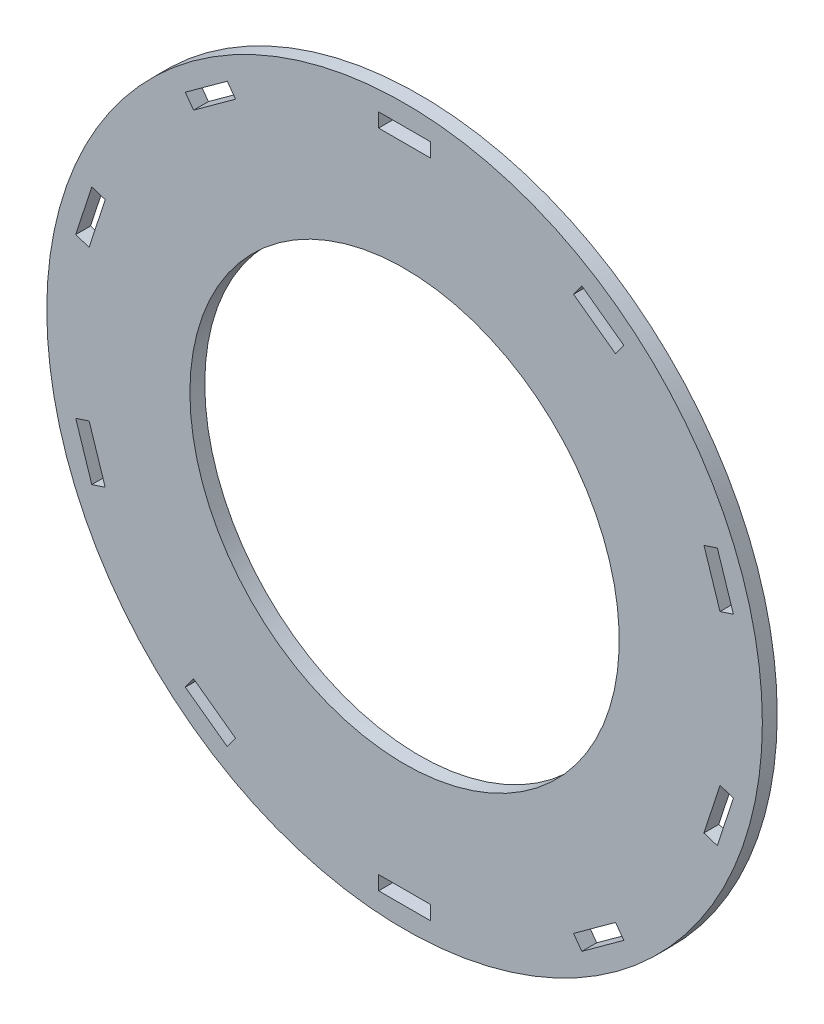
ISO-10303-21;
HEADER;
FILE_DESCRIPTION(('STEP AP214'),'2;1');
FILE_NAME('part.step','',(''),(''),'','','');
FILE_SCHEMA(('AUTOMOTIVE_DESIGN { 1 0 10303 214 1 1 1 1 }'));
ENDSEC;
DATA;
#1=APPLICATION_CONTEXT('core data for automotive mechanical design processes');
#2=APPLICATION_PROTOCOL_DEFINITION('international standard','automotive_design',2000,#1);
#3=PRODUCT_CONTEXT('',#1,'mechanical');
#4=PRODUCT('Part','Part','',(#3));
#5=PRODUCT_RELATED_PRODUCT_CATEGORY('part','',(#4));
#6=PRODUCT_DEFINITION_FORMATION('','',#4);
#7=PRODUCT_DEFINITION_CONTEXT('part definition',#1,'design');
#8=PRODUCT_DEFINITION('design','',#6,#7);
#9=PRODUCT_DEFINITION_SHAPE('','',#8);
#10=(LENGTH_UNIT() NAMED_UNIT(*) SI_UNIT(.MILLI.,.METRE.));
#11=(NAMED_UNIT(*) PLANE_ANGLE_UNIT() SI_UNIT($,.RADIAN.));
#12=(NAMED_UNIT(*) SI_UNIT($,.STERADIAN.) SOLID_ANGLE_UNIT());
#13=UNCERTAINTY_MEASURE_WITH_UNIT(LENGTH_MEASURE(1.E-05),#10,'distance_accuracy_value','');
#14=(GEOMETRIC_REPRESENTATION_CONTEXT(3) GLOBAL_UNCERTAINTY_ASSIGNED_CONTEXT((#13)) GLOBAL_UNIT_ASSIGNED_CONTEXT((#10,
#11,#12)) REPRESENTATION_CONTEXT('',''));
#15=CARTESIAN_POINT('',(0.,0.,0.));
#16=DIRECTION('',(0.,0.,1.));
#17=DIRECTION('',(1.,0.,0.));
#18=AXIS2_PLACEMENT_3D('',#15,#16,#17);
#19=CARTESIAN_POINT('',(0.,0.,2.7));
#20=DIRECTION('',(0.,0.,1.));
#21=DIRECTION('',(1.,0.,0.));
#22=AXIS2_PLACEMENT_3D('',#19,#20,#21);
#23=PLANE('',#22);
#24=DIRECTION('',(0.,1.,0.));
#25=VECTOR('',#24,1.);
#26=CARTESIAN_POINT('',(4.715,58.72,2.7));
#27=LINE('',#26,#25);
#28=CARTESIAN_POINT('',(4.715,58.72,2.7));
#29=VERTEX_POINT('',#28);
#30=CARTESIAN_POINT('',(4.715,61.28,2.7));
#31=VERTEX_POINT('',#30);
#32=EDGE_CURVE('E663',#29,#31,#27,.T.);
#33=ORIENTED_EDGE('',*,*,#32,.F.);
#34=DIRECTION('',(1.,0.,0.));
#35=VECTOR('',#34,1.);
#36=CARTESIAN_POINT('',(-4.715,58.72,2.7));
#37=LINE('',#36,#35);
#38=CARTESIAN_POINT('',(-4.715,58.72,2.7));
#39=VERTEX_POINT('',#38);
#40=EDGE_CURVE('E660',#39,#29,#37,.T.);
#41=ORIENTED_EDGE('',*,*,#40,.F.);
#42=DIRECTION('',(0.,-1.,0.));
#43=VECTOR('',#42,1.);
#44=CARTESIAN_POINT('',(-4.715,58.72,2.7));
#45=LINE('',#44,#43);
#46=CARTESIAN_POINT('',(-4.715,61.28,2.7));
#47=VERTEX_POINT('',#46);
#48=EDGE_CURVE('E671',#47,#39,#45,.T.);
#49=ORIENTED_EDGE('',*,*,#48,.F.);
#50=DIRECTION('',(-1.,0.,0.));
#51=VECTOR('',#50,1.);
#52=CARTESIAN_POINT('',(-4.715,61.28,2.7));
#53=LINE('',#52,#51);
#54=EDGE_CURVE('E667',#31,#47,#53,.T.);
#55=ORIENTED_EDGE('',*,*,#54,.F.);
#56=EDGE_LOOP('',(#33,#41,#49,#55));
#57=FACE_BOUND('',#56,.T.);
#58=DIRECTION('',(0.809016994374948,-0.587785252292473,0.));
#59=VECTOR('',#58,1.);
#60=CARTESIAN_POINT('',(30.7002348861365,50.2768853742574,2.7));
#61=LINE('',#60,#59);
#62=CARTESIAN_POINT('',(30.7002348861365,50.2768853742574,2.7));
#63=VERTEX_POINT('',#62);
#64=CARTESIAN_POINT('',(38.3292651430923,44.7340704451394,2.7));
#65=VERTEX_POINT('',#64);
#66=EDGE_CURVE('E706',#63,#65,#61,.T.);
#67=ORIENTED_EDGE('',*,*,#66,.F.);
#68=DIRECTION('',(-0.587785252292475,-0.809016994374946,0.));
#69=VECTOR('',#68,1.);
#70=CARTESIAN_POINT('',(30.7002348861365,50.2768853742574,2.7));
#71=LINE('',#70,#69);
#72=CARTESIAN_POINT('',(32.2049651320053,52.3479688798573,2.7));
#73=VERTEX_POINT('',#72);
#74=EDGE_CURVE('E703',#73,#63,#71,.T.);
#75=ORIENTED_EDGE('',*,*,#74,.F.);
#76=DIRECTION('',(-0.809016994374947,0.587785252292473,0.));
#77=VECTOR('',#76,1.);
#78=CARTESIAN_POINT('',(32.2049651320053,52.3479688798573,2.7));
#79=LINE('',#78,#77);
#80=CARTESIAN_POINT('',(39.833995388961,46.8051539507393,2.7));
#81=VERTEX_POINT('',#80);
#82=EDGE_CURVE('E714',#81,#73,#79,.T.);
#83=ORIENTED_EDGE('',*,*,#82,.F.);
#84=DIRECTION('',(0.587785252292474,0.809016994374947,0.));
#85=VECTOR('',#84,1.);
#86=CARTESIAN_POINT('',(38.3292651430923,44.7340704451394,2.7));
#87=LINE('',#86,#85);
#88=EDGE_CURVE('E710',#65,#81,#87,.T.);
#89=ORIENTED_EDGE('',*,*,#88,.F.);
#90=EDGE_LOOP('',(#67,#75,#83,#89));
#91=FACE_BOUND('',#90,.T.);
#92=CARTESIAN_POINT('',(0.,0.,2.7));
#93=DIRECTION('',(0.,0.,1.));
#94=DIRECTION('',(1.,0.,0.));
#95=AXIS2_PLACEMENT_3D('',#92,#93,#94);
#96=CIRCLE('',#95,65.);
#97=CARTESIAN_POINT('',(-65.,0.,2.7));
#98=VERTEX_POINT('',#97);
#99=EDGE_CURVE('E11',#98,#98,#96,.T.);
#100=ORIENTED_EDGE('',*,*,#99,.T.);
#101=EDGE_LOOP('',(#100));
#102=FACE_BOUND('',#101,.T.);
#103=CARTESIAN_POINT('',(0.,0.,2.7));
#104=DIRECTION('',(0.,0.,1.));
#105=DIRECTION('',(1.,0.,0.));
#106=AXIS2_PLACEMENT_3D('',#103,#104,#105);
#107=CIRCLE('',#106,39.);
#108=CARTESIAN_POINT('',(-39.,0.,2.7));
#109=VERTEX_POINT('',#108);
#110=EDGE_CURVE('E652',#109,#109,#107,.T.);
#111=ORIENTED_EDGE('',*,*,#110,.F.);
#112=EDGE_LOOP('',(#111));
#113=FACE_BOUND('',#112,.T.);
#114=DIRECTION('',(0.309016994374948,-0.951056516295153,0.));
#115=VECTOR('',#114,1.);
#116=CARTESIAN_POINT('',(54.3890235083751,22.629709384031,2.7));
#117=LINE('',#116,#115);
#118=CARTESIAN_POINT('',(54.3890235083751,22.629709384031,2.7));
#119=VERTEX_POINT('',#118);
#120=CARTESIAN_POINT('',(57.3030537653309,13.6612464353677,2.7));
#121=VERTEX_POINT('',#120);
#122=EDGE_CURVE('E612',#119,#121,#117,.T.);
#123=ORIENTED_EDGE('',*,*,#122,.F.);
#124=DIRECTION('',(-0.951056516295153,-0.309016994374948,0.));
#125=VECTOR('',#124,1.);
#126=CARTESIAN_POINT('',(54.3890235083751,22.629709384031,2.7));
#127=LINE('',#126,#125);
#128=CARTESIAN_POINT('',(56.8237281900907,23.4207928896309,2.7));
#129=VERTEX_POINT('',#128);
#130=EDGE_CURVE('E609',#129,#119,#127,.T.);
#131=ORIENTED_EDGE('',*,*,#130,.F.);
#132=DIRECTION('',(-0.309016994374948,0.951056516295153,0.));
#133=VECTOR('',#132,1.);
#134=CARTESIAN_POINT('',(56.8237281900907,23.4207928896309,2.7));
#135=LINE('',#134,#133);
#136=CARTESIAN_POINT('',(59.7377584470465,14.4523299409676,2.7));
#137=VERTEX_POINT('',#136);
#138=EDGE_CURVE('E620',#137,#129,#135,.T.);
#139=ORIENTED_EDGE('',*,*,#138,.F.);
#140=DIRECTION('',(0.951056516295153,0.309016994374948,0.));
#141=VECTOR('',#140,1.);
#142=CARTESIAN_POINT('',(57.3030537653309,13.6612464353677,2.7));
#143=LINE('',#142,#141);
#144=EDGE_CURVE('E616',#121,#137,#143,.T.);
#145=ORIENTED_EDGE('',*,*,#144,.F.);
#146=EDGE_LOOP('',(#123,#131,#139,#145));
#147=FACE_BOUND('',#146,.T.);
#148=DIRECTION('',(-0.309016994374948,-0.951056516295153,0.));
#149=VECTOR('',#148,1.);
#150=CARTESIAN_POINT('',(57.3030537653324,-13.6612464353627,2.7));
#151=LINE('',#150,#149);
#152=CARTESIAN_POINT('',(57.3030537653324,-13.6612464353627,2.7));
#153=VERTEX_POINT('',#152);
#154=CARTESIAN_POINT('',(54.3890235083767,-22.629709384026,2.7));
#155=VERTEX_POINT('',#154);
#156=EDGE_CURVE('E569',#153,#155,#151,.T.);
#157=ORIENTED_EDGE('',*,*,#156,.F.);
#158=DIRECTION('',(-0.951056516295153,0.309016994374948,0.));
#159=VECTOR('',#158,1.);
#160=CARTESIAN_POINT('',(57.3030537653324,-13.6612464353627,2.7));
#161=LINE('',#160,#159);
#162=CARTESIAN_POINT('',(59.737758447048,-14.4523299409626,2.7));
#163=VERTEX_POINT('',#162);
#164=EDGE_CURVE('E566',#163,#153,#161,.T.);
#165=ORIENTED_EDGE('',*,*,#164,.F.);
#166=DIRECTION('',(0.309016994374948,0.951056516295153,0.));
#167=VECTOR('',#166,1.);
#168=CARTESIAN_POINT('',(59.737758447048,-14.4523299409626,2.7));
#169=LINE('',#168,#167);
#170=CARTESIAN_POINT('',(56.8237281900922,-23.4207928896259,2.7));
#171=VERTEX_POINT('',#170);
#172=EDGE_CURVE('E577',#171,#163,#169,.T.);
#173=ORIENTED_EDGE('',*,*,#172,.F.);
#174=DIRECTION('',(0.951056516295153,-0.309016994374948,0.));
#175=VECTOR('',#174,1.);
#176=CARTESIAN_POINT('',(54.3890235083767,-22.629709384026,2.7));
#177=LINE('',#176,#175);
#178=EDGE_CURVE('E573',#155,#171,#177,.T.);
#179=ORIENTED_EDGE('',*,*,#178,.F.);
#180=EDGE_LOOP('',(#157,#165,#173,#179));
#181=FACE_BOUND('',#180,.T.);
#182=DIRECTION('',(-0.809016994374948,-0.587785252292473,0.));
#183=VECTOR('',#182,1.);
#184=CARTESIAN_POINT('',(38.3292651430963,-44.7340704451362,2.7));
#185=LINE('',#184,#183);
#186=CARTESIAN_POINT('',(38.3292651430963,-44.7340704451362,2.7));
#187=VERTEX_POINT('',#186);
#188=CARTESIAN_POINT('',(30.7002348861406,-50.2768853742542,2.7));
#189=VERTEX_POINT('',#188);
#190=EDGE_CURVE('E526',#187,#189,#185,.T.);
#191=ORIENTED_EDGE('',*,*,#190,.F.);
#192=DIRECTION('',(-0.587785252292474,0.809016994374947,0.));
#193=VECTOR('',#192,1.);
#194=CARTESIAN_POINT('',(38.3292651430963,-44.7340704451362,2.7));
#195=LINE('',#194,#193);
#196=CARTESIAN_POINT('',(39.8339953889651,-46.805153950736,2.7));
#197=VERTEX_POINT('',#196);
#198=EDGE_CURVE('E523',#197,#187,#195,.T.);
#199=ORIENTED_EDGE('',*,*,#198,.F.);
#200=DIRECTION('',(0.809016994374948,0.587785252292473,0.));
#201=VECTOR('',#200,1.);
#202=CARTESIAN_POINT('',(39.8339953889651,-46.805153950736,2.7));
#203=LINE('',#202,#201);
#204=CARTESIAN_POINT('',(32.2049651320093,-52.347968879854,2.7));
#205=VERTEX_POINT('',#204);
#206=EDGE_CURVE('E534',#205,#197,#203,.T.);
#207=ORIENTED_EDGE('',*,*,#206,.F.);
#208=DIRECTION('',(0.587785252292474,-0.809016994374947,0.));
#209=VECTOR('',#208,1.);
#210=CARTESIAN_POINT('',(30.7002348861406,-50.2768853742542,2.7));
#211=LINE('',#210,#209);
#212=EDGE_CURVE('E530',#189,#205,#211,.T.);
#213=ORIENTED_EDGE('',*,*,#212,.F.);
#214=EDGE_LOOP('',(#191,#199,#207,#213));
#215=FACE_BOUND('',#214,.T.);
#216=DIRECTION('',(-1.,0.,0.));
#217=VECTOR('',#216,1.);
#218=CARTESIAN_POINT('',(4.71500000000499,-58.7199999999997,2.7));
#219=LINE('',#218,#217);
#220=CARTESIAN_POINT('',(4.71500000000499,-58.7199999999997,2.7));
#221=VERTEX_POINT('',#220);
#222=CARTESIAN_POINT('',(-4.71499999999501,-58.7199999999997,2.7));
#223=VERTEX_POINT('',#222);
#224=EDGE_CURVE('E483',#221,#223,#219,.T.);
#225=ORIENTED_EDGE('',*,*,#224,.F.);
#226=DIRECTION('',(0.,1.,0.));
#227=VECTOR('',#226,1.);
#228=CARTESIAN_POINT('',(4.71500000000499,-58.7199999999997,2.7));
#229=LINE('',#228,#227);
#230=CARTESIAN_POINT('',(4.71500000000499,-61.2799999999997,2.7));
#231=VERTEX_POINT('',#230);
#232=EDGE_CURVE('E480',#231,#221,#229,.T.);
#233=ORIENTED_EDGE('',*,*,#232,.F.);
#234=DIRECTION('',(1.,0.,0.));
#235=VECTOR('',#234,1.);
#236=CARTESIAN_POINT('',(4.71500000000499,-61.2799999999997,2.7));
#237=LINE('',#236,#235);
#238=CARTESIAN_POINT('',(-4.71499999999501,-61.2799999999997,2.7));
#239=VERTEX_POINT('',#238);
#240=EDGE_CURVE('E491',#239,#231,#237,.T.);
#241=ORIENTED_EDGE('',*,*,#240,.F.);
#242=DIRECTION('',(0.,-1.,0.));
#243=VECTOR('',#242,1.);
#244=CARTESIAN_POINT('',(-4.71499999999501,-58.7199999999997,2.7));
#245=LINE('',#244,#243);
#246=EDGE_CURVE('E487',#223,#239,#245,.T.);
#247=ORIENTED_EDGE('',*,*,#246,.F.);
#248=EDGE_LOOP('',(#225,#233,#241,#247));
#249=FACE_BOUND('',#248,.T.);
#250=DIRECTION('',(-0.809016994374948,0.587785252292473,0.));
#251=VECTOR('',#250,1.);
#252=CARTESIAN_POINT('',(-30.7002348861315,-50.2768853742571,2.7));
#253=LINE('',#252,#251);
#254=CARTESIAN_POINT('',(-30.7002348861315,-50.2768853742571,2.7));
#255=VERTEX_POINT('',#254);
#256=CARTESIAN_POINT('',(-38.3292651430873,-44.7340704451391,2.7));
#257=VERTEX_POINT('',#256);
#258=EDGE_CURVE('E440',#255,#257,#253,.T.);
#259=ORIENTED_EDGE('',*,*,#258,.F.);
#260=DIRECTION('',(0.587785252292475,0.809016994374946,0.));
#261=VECTOR('',#260,1.);
#262=CARTESIAN_POINT('',(-30.7002348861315,-50.2768853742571,2.7));
#263=LINE('',#262,#261);
#264=CARTESIAN_POINT('',(-32.2049651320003,-52.347968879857,2.7));
#265=VERTEX_POINT('',#264);
#266=EDGE_CURVE('E437',#265,#255,#263,.T.);
#267=ORIENTED_EDGE('',*,*,#266,.F.);
#268=DIRECTION('',(0.809016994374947,-0.587785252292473,0.));
#269=VECTOR('',#268,1.);
#270=CARTESIAN_POINT('',(-32.2049651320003,-52.347968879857,2.7));
#271=LINE('',#270,#269);
#272=CARTESIAN_POINT('',(-39.833995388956,-46.805153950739,2.7));
#273=VERTEX_POINT('',#272);
#274=EDGE_CURVE('E448',#273,#265,#271,.T.);
#275=ORIENTED_EDGE('',*,*,#274,.F.);
#276=DIRECTION('',(-0.587785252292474,-0.809016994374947,0.));
#277=VECTOR('',#276,1.);
#278=CARTESIAN_POINT('',(-38.3292651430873,-44.7340704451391,2.7));
#279=LINE('',#278,#277);
#280=EDGE_CURVE('E444',#257,#273,#279,.T.);
#281=ORIENTED_EDGE('',*,*,#280,.F.);
#282=EDGE_LOOP('',(#259,#267,#275,#281));
#283=FACE_BOUND('',#282,.T.);
#284=DIRECTION('',(-0.309016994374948,0.951056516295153,0.));
#285=VECTOR('',#284,1.);
#286=CARTESIAN_POINT('',(-54.3890235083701,-22.6297093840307,2.7));
#287=LINE('',#286,#285);
#288=CARTESIAN_POINT('',(-54.3890235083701,-22.6297093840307,2.7));
#289=VERTEX_POINT('',#288);
#290=CARTESIAN_POINT('',(-57.3030537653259,-13.6612464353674,2.7));
#291=VERTEX_POINT('',#290);
#292=EDGE_CURVE('E397',#289,#291,#287,.T.);
#293=ORIENTED_EDGE('',*,*,#292,.F.);
#294=DIRECTION('',(0.951056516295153,0.309016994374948,0.));
#295=VECTOR('',#294,1.);
#296=CARTESIAN_POINT('',(-54.3890235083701,-22.6297093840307,2.7));
#297=LINE('',#296,#295);
#298=CARTESIAN_POINT('',(-56.8237281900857,-23.4207928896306,2.7));
#299=VERTEX_POINT('',#298);
#300=EDGE_CURVE('E394',#299,#289,#297,.T.);
#301=ORIENTED_EDGE('',*,*,#300,.F.);
#302=DIRECTION('',(0.309016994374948,-0.951056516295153,0.));
#303=VECTOR('',#302,1.);
#304=CARTESIAN_POINT('',(-56.8237281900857,-23.4207928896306,2.7));
#305=LINE('',#304,#303);
#306=CARTESIAN_POINT('',(-59.7377584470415,-14.4523299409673,2.7));
#307=VERTEX_POINT('',#306);
#308=EDGE_CURVE('E405',#307,#299,#305,.T.);
#309=ORIENTED_EDGE('',*,*,#308,.F.);
#310=DIRECTION('',(-0.951056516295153,-0.309016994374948,0.));
#311=VECTOR('',#310,1.);
#312=CARTESIAN_POINT('',(-57.3030537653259,-13.6612464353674,2.7));
#313=LINE('',#312,#311);
#314=EDGE_CURVE('E401',#291,#307,#313,.T.);
#315=ORIENTED_EDGE('',*,*,#314,.F.);
#316=EDGE_LOOP('',(#293,#301,#309,#315));
#317=FACE_BOUND('',#316,.T.);
#318=DIRECTION('',(0.309016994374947,0.951056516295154,0.));
#319=VECTOR('',#318,1.);
#320=CARTESIAN_POINT('',(-57.3030537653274,13.661246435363,2.7));
#321=LINE('',#320,#319);
#322=CARTESIAN_POINT('',(-57.3030537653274,13.661246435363,2.7));
#323=VERTEX_POINT('',#322);
#324=CARTESIAN_POINT('',(-54.3890235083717,22.6297093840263,2.7));
#325=VERTEX_POINT('',#324);
#326=EDGE_CURVE('E354',#323,#325,#321,.T.);
#327=ORIENTED_EDGE('',*,*,#326,.F.);
#328=DIRECTION('',(0.951056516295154,-0.309016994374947,0.));
#329=VECTOR('',#328,1.);
#330=CARTESIAN_POINT('',(-57.3030537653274,13.661246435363,2.7));
#331=LINE('',#330,#329);
#332=CARTESIAN_POINT('',(-59.737758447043,14.4523299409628,2.7));
#333=VERTEX_POINT('',#332);
#334=EDGE_CURVE('E351',#333,#323,#331,.T.);
#335=ORIENTED_EDGE('',*,*,#334,.F.);
#336=DIRECTION('',(-0.309016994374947,-0.951056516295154,0.));
#337=VECTOR('',#336,1.);
#338=CARTESIAN_POINT('',(-59.737758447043,14.4523299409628,2.7));
#339=LINE('',#338,#337);
#340=CARTESIAN_POINT('',(-56.8237281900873,23.4207928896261,2.7));
#341=VERTEX_POINT('',#340);
#342=EDGE_CURVE('E362',#341,#333,#339,.T.);
#343=ORIENTED_EDGE('',*,*,#342,.F.);
#344=DIRECTION('',(-0.951056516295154,0.309016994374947,0.));
#345=VECTOR('',#344,1.);
#346=CARTESIAN_POINT('',(-54.3890235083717,22.6297093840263,2.7));
#347=LINE('',#346,#345);
#348=EDGE_CURVE('E358',#325,#341,#347,.T.);
#349=ORIENTED_EDGE('',*,*,#348,.F.);
#350=EDGE_LOOP('',(#327,#335,#343,#349));
#351=FACE_BOUND('',#350,.T.);
#352=DIRECTION('',(0.809016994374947,0.587785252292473,0.));
#353=VECTOR('',#352,1.);
#354=CARTESIAN_POINT('',(-38.3292651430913,44.7340704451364,2.7));
#355=LINE('',#354,#353);
#356=CARTESIAN_POINT('',(-38.3292651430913,44.7340704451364,2.7));
#357=VERTEX_POINT('',#356);
#358=CARTESIAN_POINT('',(-30.7002348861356,50.2768853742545,2.7));
#359=VERTEX_POINT('',#358);
#360=EDGE_CURVE('E312',#357,#359,#355,.T.);
#361=ORIENTED_EDGE('',*,*,#360,.F.);
#362=DIRECTION('',(0.587785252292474,-0.809016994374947,0.));
#363=VECTOR('',#362,1.);
#364=CARTESIAN_POINT('',(-38.3292651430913,44.7340704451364,2.7));
#365=LINE('',#364,#363);
#366=CARTESIAN_POINT('',(-39.8339953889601,46.8051539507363,2.7));
#367=VERTEX_POINT('',#366);
#368=EDGE_CURVE('E303',#367,#357,#365,.T.);
#369=ORIENTED_EDGE('',*,*,#368,.F.);
#370=DIRECTION('',(-0.809016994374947,-0.587785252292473,0.));
#371=VECTOR('',#370,1.);
#372=CARTESIAN_POINT('',(-39.8339953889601,46.8051539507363,2.7));
#373=LINE('',#372,#371);
#374=CARTESIAN_POINT('',(-32.2049651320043,52.3479688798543,2.7));
#375=VERTEX_POINT('',#374);
#376=EDGE_CURVE('E329',#375,#367,#373,.T.);
#377=ORIENTED_EDGE('',*,*,#376,.F.);
#378=DIRECTION('',(-0.587785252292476,0.809016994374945,0.));
#379=VECTOR('',#378,1.);
#380=CARTESIAN_POINT('',(-30.7002348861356,50.2768853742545,2.7));
#381=LINE('',#380,#379);
#382=EDGE_CURVE('E325',#359,#375,#381,.T.);
#383=ORIENTED_EDGE('',*,*,#382,.F.);
#384=EDGE_LOOP('',(#361,#369,#377,#383));
#385=FACE_BOUND('',#384,.T.);
#386=ADVANCED_FACE('F45',(#57,#91,#102,#113,#147,#181,#215,#249,#283,#317,#351,#385),#23,.T.);
#387=CARTESIAN_POINT('',(0.,0.,0.));
#388=DIRECTION('',(0.,0.,1.));
#389=DIRECTION('',(1.,0.,0.));
#390=AXIS2_PLACEMENT_3D('',#387,#388,#389);
#391=PLANE('',#390);
#392=DIRECTION('',(0.951056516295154,-0.309016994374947,0.));
#393=VECTOR('',#392,1.);
#394=CARTESIAN_POINT('',(-57.3030537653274,13.661246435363,0.));
#395=LINE('',#394,#393);
#396=CARTESIAN_POINT('',(-59.737758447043,14.4523299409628,0.));
#397=VERTEX_POINT('',#396);
#398=CARTESIAN_POINT('',(-57.3030537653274,13.661246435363,0.));
#399=VERTEX_POINT('',#398);
#400=EDGE_CURVE('E321',#397,#399,#395,.T.);
#401=ORIENTED_EDGE('',*,*,#400,.T.);
#402=DIRECTION('',(0.309016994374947,0.951056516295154,0.));
#403=VECTOR('',#402,1.);
#404=CARTESIAN_POINT('',(-57.3030537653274,13.661246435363,0.));
#405=LINE('',#404,#403);
#406=CARTESIAN_POINT('',(-54.3890235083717,22.6297093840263,0.));
#407=VERTEX_POINT('',#406);
#408=EDGE_CURVE('E369',#399,#407,#405,.T.);
#409=ORIENTED_EDGE('',*,*,#408,.T.);
#410=DIRECTION('',(-0.951056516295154,0.309016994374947,0.));
#411=VECTOR('',#410,1.);
#412=CARTESIAN_POINT('',(-54.3890235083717,22.6297093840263,0.));
#413=LINE('',#412,#411);
#414=CARTESIAN_POINT('',(-56.8237281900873,23.4207928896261,0.));
#415=VERTEX_POINT('',#414);
#416=EDGE_CURVE('E373',#407,#415,#413,.T.);
#417=ORIENTED_EDGE('',*,*,#416,.T.);
#418=DIRECTION('',(-0.309016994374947,-0.951056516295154,0.));
#419=VECTOR('',#418,1.);
#420=CARTESIAN_POINT('',(-59.737758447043,14.4523299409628,0.));
#421=LINE('',#420,#419);
#422=EDGE_CURVE('E355',#415,#397,#421,.T.);
#423=ORIENTED_EDGE('',*,*,#422,.T.);
#424=EDGE_LOOP('',(#401,#409,#417,#423));
#425=FACE_BOUND('',#424,.T.);
#426=DIRECTION('',(0.587785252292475,0.809016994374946,0.));
#427=VECTOR('',#426,1.);
#428=CARTESIAN_POINT('',(-30.7002348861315,-50.2768853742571,0.));
#429=LINE('',#428,#427);
#430=CARTESIAN_POINT('',(-32.2049651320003,-52.347968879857,0.));
#431=VERTEX_POINT('',#430);
#432=CARTESIAN_POINT('',(-30.7002348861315,-50.2768853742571,0.));
#433=VERTEX_POINT('',#432);
#434=EDGE_CURVE('E436',#431,#433,#429,.T.);
#435=ORIENTED_EDGE('',*,*,#434,.T.);
#436=DIRECTION('',(-0.809016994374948,0.587785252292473,0.));
#437=VECTOR('',#436,1.);
#438=CARTESIAN_POINT('',(-30.7002348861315,-50.2768853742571,0.));
#439=LINE('',#438,#437);
#440=CARTESIAN_POINT('',(-38.3292651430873,-44.7340704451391,0.));
#441=VERTEX_POINT('',#440);
#442=EDGE_CURVE('E455',#433,#441,#439,.T.);
#443=ORIENTED_EDGE('',*,*,#442,.T.);
#444=DIRECTION('',(-0.587785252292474,-0.809016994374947,0.));
#445=VECTOR('',#444,1.);
#446=CARTESIAN_POINT('',(-38.3292651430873,-44.7340704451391,0.));
#447=LINE('',#446,#445);
#448=CARTESIAN_POINT('',(-39.833995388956,-46.805153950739,0.));
#449=VERTEX_POINT('',#448);
#450=EDGE_CURVE('E459',#441,#449,#447,.T.);
#451=ORIENTED_EDGE('',*,*,#450,.T.);
#452=DIRECTION('',(0.809016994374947,-0.587785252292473,0.));
#453=VECTOR('',#452,1.);
#454=CARTESIAN_POINT('',(-32.2049651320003,-52.347968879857,0.));
#455=LINE('',#454,#453);
#456=EDGE_CURVE('E441',#449,#431,#455,.T.);
#457=ORIENTED_EDGE('',*,*,#456,.T.);
#458=EDGE_LOOP('',(#435,#443,#451,#457));
#459=FACE_BOUND('',#458,.T.);
#460=DIRECTION('',(-0.587785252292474,0.809016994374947,0.));
#461=VECTOR('',#460,1.);
#462=CARTESIAN_POINT('',(38.3292651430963,-44.7340704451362,0.));
#463=LINE('',#462,#461);
#464=CARTESIAN_POINT('',(39.8339953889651,-46.805153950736,0.));
#465=VERTEX_POINT('',#464);
#466=CARTESIAN_POINT('',(38.3292651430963,-44.7340704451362,0.));
#467=VERTEX_POINT('',#466);
#468=EDGE_CURVE('E522',#465,#467,#463,.T.);
#469=ORIENTED_EDGE('',*,*,#468,.T.);
#470=DIRECTION('',(-0.809016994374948,-0.587785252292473,0.));
#471=VECTOR('',#470,1.);
#472=CARTESIAN_POINT('',(38.3292651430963,-44.7340704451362,0.));
#473=LINE('',#472,#471);
#474=CARTESIAN_POINT('',(30.7002348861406,-50.2768853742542,0.));
#475=VERTEX_POINT('',#474);
#476=EDGE_CURVE('E541',#467,#475,#473,.T.);
#477=ORIENTED_EDGE('',*,*,#476,.T.);
#478=DIRECTION('',(0.587785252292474,-0.809016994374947,0.));
#479=VECTOR('',#478,1.);
#480=CARTESIAN_POINT('',(30.7002348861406,-50.2768853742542,0.));
#481=LINE('',#480,#479);
#482=CARTESIAN_POINT('',(32.2049651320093,-52.347968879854,0.));
#483=VERTEX_POINT('',#482);
#484=EDGE_CURVE('E545',#475,#483,#481,.T.);
#485=ORIENTED_EDGE('',*,*,#484,.T.);
#486=DIRECTION('',(0.809016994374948,0.587785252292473,0.));
#487=VECTOR('',#486,1.);
#488=CARTESIAN_POINT('',(39.8339953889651,-46.805153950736,0.));
#489=LINE('',#488,#487);
#490=EDGE_CURVE('E527',#483,#465,#489,.T.);
#491=ORIENTED_EDGE('',*,*,#490,.T.);
#492=EDGE_LOOP('',(#469,#477,#485,#491));
#493=FACE_BOUND('',#492,.T.);
#494=DIRECTION('',(-0.951056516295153,-0.309016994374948,0.));
#495=VECTOR('',#494,1.);
#496=CARTESIAN_POINT('',(54.3890235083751,22.629709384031,0.));
#497=LINE('',#496,#495);
#498=CARTESIAN_POINT('',(56.8237281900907,23.4207928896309,0.));
#499=VERTEX_POINT('',#498);
#500=CARTESIAN_POINT('',(54.3890235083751,22.629709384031,0.));
#501=VERTEX_POINT('',#500);
#502=EDGE_CURVE('E608',#499,#501,#497,.T.);
#503=ORIENTED_EDGE('',*,*,#502,.T.);
#504=DIRECTION('',(0.309016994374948,-0.951056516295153,0.));
#505=VECTOR('',#504,1.);
#506=CARTESIAN_POINT('',(54.3890235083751,22.629709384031,0.));
#507=LINE('',#506,#505);
#508=CARTESIAN_POINT('',(57.3030537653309,13.6612464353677,0.));
#509=VERTEX_POINT('',#508);
#510=EDGE_CURVE('E627',#501,#509,#507,.T.);
#511=ORIENTED_EDGE('',*,*,#510,.T.);
#512=DIRECTION('',(0.951056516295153,0.309016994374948,0.));
#513=VECTOR('',#512,1.);
#514=CARTESIAN_POINT('',(57.3030537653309,13.6612464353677,0.));
#515=LINE('',#514,#513);
#516=CARTESIAN_POINT('',(59.7377584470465,14.4523299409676,0.));
#517=VERTEX_POINT('',#516);
#518=EDGE_CURVE('E631',#509,#517,#515,.T.);
#519=ORIENTED_EDGE('',*,*,#518,.T.);
#520=DIRECTION('',(-0.309016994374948,0.951056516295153,0.));
#521=VECTOR('',#520,1.);
#522=CARTESIAN_POINT('',(56.8237281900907,23.4207928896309,0.));
#523=LINE('',#522,#521);
#524=EDGE_CURVE('E613',#517,#499,#523,.T.);
#525=ORIENTED_EDGE('',*,*,#524,.T.);
#526=EDGE_LOOP('',(#503,#511,#519,#525));
#527=FACE_BOUND('',#526,.T.);
#528=DIRECTION('',(-0.587785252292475,-0.809016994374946,0.));
#529=VECTOR('',#528,1.);
#530=CARTESIAN_POINT('',(30.7002348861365,50.2768853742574,0.));
#531=LINE('',#530,#529);
#532=CARTESIAN_POINT('',(32.2049651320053,52.3479688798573,0.));
#533=VERTEX_POINT('',#532);
#534=CARTESIAN_POINT('',(30.7002348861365,50.2768853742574,0.));
#535=VERTEX_POINT('',#534);
#536=EDGE_CURVE('E702',#533,#535,#531,.T.);
#537=ORIENTED_EDGE('',*,*,#536,.T.);
#538=DIRECTION('',(0.809016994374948,-0.587785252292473,0.));
#539=VECTOR('',#538,1.);
#540=CARTESIAN_POINT('',(30.7002348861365,50.2768853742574,0.));
#541=LINE('',#540,#539);
#542=CARTESIAN_POINT('',(38.3292651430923,44.7340704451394,0.));
#543=VERTEX_POINT('',#542);
#544=EDGE_CURVE('E721',#535,#543,#541,.T.);
#545=ORIENTED_EDGE('',*,*,#544,.T.);
#546=DIRECTION('',(0.587785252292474,0.809016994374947,0.));
#547=VECTOR('',#546,1.);
#548=CARTESIAN_POINT('',(38.3292651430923,44.7340704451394,0.));
#549=LINE('',#548,#547);
#550=CARTESIAN_POINT('',(39.833995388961,46.8051539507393,0.));
#551=VERTEX_POINT('',#550);
#552=EDGE_CURVE('E725',#543,#551,#549,.T.);
#553=ORIENTED_EDGE('',*,*,#552,.T.);
#554=DIRECTION('',(-0.809016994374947,0.587785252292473,0.));
#555=VECTOR('',#554,1.);
#556=CARTESIAN_POINT('',(32.2049651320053,52.3479688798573,0.));
#557=LINE('',#556,#555);
#558=EDGE_CURVE('E707',#551,#533,#557,.T.);
#559=ORIENTED_EDGE('',*,*,#558,.T.);
#560=EDGE_LOOP('',(#537,#545,#553,#559));
#561=FACE_BOUND('',#560,.T.);
#562=CARTESIAN_POINT('',(0.,0.,0.));
#563=DIRECTION('',(0.,0.,1.));
#564=DIRECTION('',(1.,0.,0.));
#565=AXIS2_PLACEMENT_3D('',#562,#563,#564);
#566=CIRCLE('',#565,65.);
#567=CARTESIAN_POINT('',(-65.,0.,0.));
#568=VERTEX_POINT('',#567);
#569=EDGE_CURVE('E49',#568,#568,#566,.T.);
#570=ORIENTED_EDGE('',*,*,#569,.F.);
#571=EDGE_LOOP('',(#570));
#572=FACE_BOUND('',#571,.T.);
#573=DIRECTION('',(1.,0.,0.));
#574=VECTOR('',#573,1.);
#575=CARTESIAN_POINT('',(-4.715,58.72,0.));
#576=LINE('',#575,#574);
#577=CARTESIAN_POINT('',(-4.715,58.72,0.));
#578=VERTEX_POINT('',#577);
#579=CARTESIAN_POINT('',(4.715,58.72,0.));
#580=VERTEX_POINT('',#579);
#581=EDGE_CURVE('E656',#578,#580,#576,.T.);
#582=ORIENTED_EDGE('',*,*,#581,.T.);
#583=DIRECTION('',(0.,1.,0.));
#584=VECTOR('',#583,1.);
#585=CARTESIAN_POINT('',(4.715,58.72,0.));
#586=LINE('',#585,#584);
#587=CARTESIAN_POINT('',(4.715,61.28,0.));
#588=VERTEX_POINT('',#587);
#589=EDGE_CURVE('E678',#580,#588,#586,.T.);
#590=ORIENTED_EDGE('',*,*,#589,.T.);
#591=DIRECTION('',(-1.,0.,0.));
#592=VECTOR('',#591,1.);
#593=CARTESIAN_POINT('',(-4.715,61.28,0.));
#594=LINE('',#593,#592);
#595=CARTESIAN_POINT('',(-4.715,61.28,0.));
#596=VERTEX_POINT('',#595);
#597=EDGE_CURVE('E682',#588,#596,#594,.T.);
#598=ORIENTED_EDGE('',*,*,#597,.T.);
#599=DIRECTION('',(0.,-1.,0.));
#600=VECTOR('',#599,1.);
#601=CARTESIAN_POINT('',(-4.715,58.72,0.));
#602=LINE('',#601,#600);
#603=EDGE_CURVE('E664',#596,#578,#602,.T.);
#604=ORIENTED_EDGE('',*,*,#603,.T.);
#605=EDGE_LOOP('',(#582,#590,#598,#604));
#606=FACE_BOUND('',#605,.T.);
#607=CARTESIAN_POINT('',(0.,0.,0.));
#608=DIRECTION('',(0.,0.,1.));
#609=DIRECTION('',(1.,0.,0.));
#610=AXIS2_PLACEMENT_3D('',#607,#608,#609);
#611=CIRCLE('',#610,39.);
#612=CARTESIAN_POINT('',(-39.,0.,0.));
#613=VERTEX_POINT('',#612);
#614=EDGE_CURVE('E651',#613,#613,#611,.T.);
#615=ORIENTED_EDGE('',*,*,#614,.T.);
#616=EDGE_LOOP('',(#615));
#617=FACE_BOUND('',#616,.T.);
#618=DIRECTION('',(-0.951056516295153,0.309016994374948,0.));
#619=VECTOR('',#618,1.);
#620=CARTESIAN_POINT('',(57.3030537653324,-13.6612464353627,0.));
#621=LINE('',#620,#619);
#622=CARTESIAN_POINT('',(59.737758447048,-14.4523299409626,0.));
#623=VERTEX_POINT('',#622);
#624=CARTESIAN_POINT('',(57.3030537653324,-13.6612464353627,0.));
#625=VERTEX_POINT('',#624);
#626=EDGE_CURVE('E565',#623,#625,#621,.T.);
#627=ORIENTED_EDGE('',*,*,#626,.T.);
#628=DIRECTION('',(-0.309016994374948,-0.951056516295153,0.));
#629=VECTOR('',#628,1.);
#630=CARTESIAN_POINT('',(57.3030537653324,-13.6612464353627,0.));
#631=LINE('',#630,#629);
#632=CARTESIAN_POINT('',(54.3890235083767,-22.629709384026,0.));
#633=VERTEX_POINT('',#632);
#634=EDGE_CURVE('E584',#625,#633,#631,.T.);
#635=ORIENTED_EDGE('',*,*,#634,.T.);
#636=DIRECTION('',(0.951056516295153,-0.309016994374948,0.));
#637=VECTOR('',#636,1.);
#638=CARTESIAN_POINT('',(54.3890235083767,-22.629709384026,0.));
#639=LINE('',#638,#637);
#640=CARTESIAN_POINT('',(56.8237281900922,-23.4207928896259,0.));
#641=VERTEX_POINT('',#640);
#642=EDGE_CURVE('E588',#633,#641,#639,.T.);
#643=ORIENTED_EDGE('',*,*,#642,.T.);
#644=DIRECTION('',(0.309016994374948,0.951056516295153,0.));
#645=VECTOR('',#644,1.);
#646=CARTESIAN_POINT('',(59.737758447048,-14.4523299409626,0.));
#647=LINE('',#646,#645);
#648=EDGE_CURVE('E570',#641,#623,#647,.T.);
#649=ORIENTED_EDGE('',*,*,#648,.T.);
#650=EDGE_LOOP('',(#627,#635,#643,#649));
#651=FACE_BOUND('',#650,.T.);
#652=DIRECTION('',(0.,1.,0.));
#653=VECTOR('',#652,1.);
#654=CARTESIAN_POINT('',(4.71500000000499,-58.7199999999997,0.));
#655=LINE('',#654,#653);
#656=CARTESIAN_POINT('',(4.71500000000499,-61.2799999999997,0.));
#657=VERTEX_POINT('',#656);
#658=CARTESIAN_POINT('',(4.71500000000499,-58.7199999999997,0.));
#659=VERTEX_POINT('',#658);
#660=EDGE_CURVE('E479',#657,#659,#655,.T.);
#661=ORIENTED_EDGE('',*,*,#660,.T.);
#662=DIRECTION('',(-1.,0.,0.));
#663=VECTOR('',#662,1.);
#664=CARTESIAN_POINT('',(4.71500000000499,-58.7199999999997,0.));
#665=LINE('',#664,#663);
#666=CARTESIAN_POINT('',(-4.71499999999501,-58.7199999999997,0.));
#667=VERTEX_POINT('',#666);
#668=EDGE_CURVE('E498',#659,#667,#665,.T.);
#669=ORIENTED_EDGE('',*,*,#668,.T.);
#670=DIRECTION('',(0.,-1.,0.));
#671=VECTOR('',#670,1.);
#672=CARTESIAN_POINT('',(-4.71499999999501,-58.7199999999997,0.));
#673=LINE('',#672,#671);
#674=CARTESIAN_POINT('',(-4.71499999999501,-61.2799999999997,0.));
#675=VERTEX_POINT('',#674);
#676=EDGE_CURVE('E502',#667,#675,#673,.T.);
#677=ORIENTED_EDGE('',*,*,#676,.T.);
#678=DIRECTION('',(1.,0.,0.));
#679=VECTOR('',#678,1.);
#680=CARTESIAN_POINT('',(4.71500000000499,-61.2799999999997,0.));
#681=LINE('',#680,#679);
#682=EDGE_CURVE('E484',#675,#657,#681,.T.);
#683=ORIENTED_EDGE('',*,*,#682,.T.);
#684=EDGE_LOOP('',(#661,#669,#677,#683));
#685=FACE_BOUND('',#684,.T.);
#686=DIRECTION('',(0.951056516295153,0.309016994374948,0.));
#687=VECTOR('',#686,1.);
#688=CARTESIAN_POINT('',(-54.3890235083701,-22.6297093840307,0.));
#689=LINE('',#688,#687);
#690=CARTESIAN_POINT('',(-56.8237281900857,-23.4207928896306,0.));
#691=VERTEX_POINT('',#690);
#692=CARTESIAN_POINT('',(-54.3890235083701,-22.6297093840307,0.));
#693=VERTEX_POINT('',#692);
#694=EDGE_CURVE('E393',#691,#693,#689,.T.);
#695=ORIENTED_EDGE('',*,*,#694,.T.);
#696=DIRECTION('',(-0.309016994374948,0.951056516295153,0.));
#697=VECTOR('',#696,1.);
#698=CARTESIAN_POINT('',(-54.3890235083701,-22.6297093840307,0.));
#699=LINE('',#698,#697);
#700=CARTESIAN_POINT('',(-57.3030537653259,-13.6612464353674,0.));
#701=VERTEX_POINT('',#700);
#702=EDGE_CURVE('E412',#693,#701,#699,.T.);
#703=ORIENTED_EDGE('',*,*,#702,.T.);
#704=DIRECTION('',(-0.951056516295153,-0.309016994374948,0.));
#705=VECTOR('',#704,1.);
#706=CARTESIAN_POINT('',(-57.3030537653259,-13.6612464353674,0.));
#707=LINE('',#706,#705);
#708=CARTESIAN_POINT('',(-59.7377584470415,-14.4523299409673,0.));
#709=VERTEX_POINT('',#708);
#710=EDGE_CURVE('E416',#701,#709,#707,.T.);
#711=ORIENTED_EDGE('',*,*,#710,.T.);
#712=DIRECTION('',(0.309016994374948,-0.951056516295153,0.));
#713=VECTOR('',#712,1.);
#714=CARTESIAN_POINT('',(-56.8237281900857,-23.4207928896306,0.));
#715=LINE('',#714,#713);
#716=EDGE_CURVE('E398',#709,#691,#715,.T.);
#717=ORIENTED_EDGE('',*,*,#716,.T.);
#718=EDGE_LOOP('',(#695,#703,#711,#717));
#719=FACE_BOUND('',#718,.T.);
#720=DIRECTION('',(0.587785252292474,-0.809016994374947,0.));
#721=VECTOR('',#720,1.);
#722=CARTESIAN_POINT('',(-38.3292651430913,44.7340704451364,0.));
#723=LINE('',#722,#721);
#724=CARTESIAN_POINT('',(-39.8339953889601,46.8051539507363,0.));
#725=VERTEX_POINT('',#724);
#726=CARTESIAN_POINT('',(-38.3292651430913,44.7340704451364,0.));
#727=VERTEX_POINT('',#726);
#728=EDGE_CURVE('E69',#725,#727,#723,.T.);
#729=ORIENTED_EDGE('',*,*,#728,.T.);
#730=DIRECTION('',(0.809016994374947,0.587785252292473,0.));
#731=VECTOR('',#730,1.);
#732=CARTESIAN_POINT('',(-38.3292651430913,44.7340704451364,0.));
#733=LINE('',#732,#731);
#734=CARTESIAN_POINT('',(-30.7002348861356,50.2768853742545,0.));
#735=VERTEX_POINT('',#734);
#736=EDGE_CURVE('E319',#727,#735,#733,.T.);
#737=ORIENTED_EDGE('',*,*,#736,.T.);
#738=DIRECTION('',(-0.587785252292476,0.809016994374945,0.));
#739=VECTOR('',#738,1.);
#740=CARTESIAN_POINT('',(-30.7002348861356,50.2768853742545,0.));
#741=LINE('',#740,#739);
#742=CARTESIAN_POINT('',(-32.2049651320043,52.3479688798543,0.));
#743=VERTEX_POINT('',#742);
#744=EDGE_CURVE('E338',#735,#743,#741,.T.);
#745=ORIENTED_EDGE('',*,*,#744,.T.);
#746=DIRECTION('',(-0.809016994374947,-0.587785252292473,0.));
#747=VECTOR('',#746,1.);
#748=CARTESIAN_POINT('',(-39.8339953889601,46.8051539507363,0.));
#749=LINE('',#748,#747);
#750=EDGE_CURVE('E313',#743,#725,#749,.T.);
#751=ORIENTED_EDGE('',*,*,#750,.T.);
#752=EDGE_LOOP('',(#729,#737,#745,#751));
#753=FACE_BOUND('',#752,.T.);
#754=ADVANCED_FACE('F751',(#425,#459,#493,#527,#561,#572,#606,#617,#651,#685,#719,#753),#391,.F.);
#755=CARTESIAN_POINT('',(0.,0.,2.7));
#756=DIRECTION('',(0.,0.,-1.));
#757=DIRECTION('',(-1.,0.,0.));
#758=AXIS2_PLACEMENT_3D('',#755,#756,#757);
#759=CYLINDRICAL_SURFACE('',#758,65.);
#760=CARTESIAN_POINT('',(-65.,0.,2.7));
#761=CARTESIAN_POINT('',(-65.,0.,2.671875));
#762=CARTESIAN_POINT('',(-65.,0.,2.64375));
#763=CARTESIAN_POINT('',(-65.,0.,2.5875));
#764=CARTESIAN_POINT('',(-65.,0.,2.559375));
#765=CARTESIAN_POINT('',(-65.,0.,2.503125));
#766=CARTESIAN_POINT('',(-65.,0.,2.475));
#767=CARTESIAN_POINT('',(-65.,0.,2.41875));
#768=CARTESIAN_POINT('',(-65.,0.,2.390625));
#769=CARTESIAN_POINT('',(-65.,0.,2.334375));
#770=CARTESIAN_POINT('',(-65.,0.,2.30625));
#771=CARTESIAN_POINT('',(-65.,0.,2.25));
#772=CARTESIAN_POINT('',(-65.,0.,2.221875));
#773=CARTESIAN_POINT('',(-65.,0.,2.165625));
#774=CARTESIAN_POINT('',(-65.,0.,2.1375));
#775=CARTESIAN_POINT('',(-65.,0.,2.08125));
#776=CARTESIAN_POINT('',(-65.,0.,2.053125));
#777=CARTESIAN_POINT('',(-65.,0.,1.996875));
#778=CARTESIAN_POINT('',(-65.,0.,1.96875));
#779=CARTESIAN_POINT('',(-65.,0.,1.9125));
#780=CARTESIAN_POINT('',(-65.,0.,1.884375));
#781=CARTESIAN_POINT('',(-65.,0.,1.828125));
#782=CARTESIAN_POINT('',(-65.,0.,1.8));
#783=CARTESIAN_POINT('',(-65.,0.,1.74375));
#784=CARTESIAN_POINT('',(-65.,0.,1.715625));
#785=CARTESIAN_POINT('',(-65.,0.,1.659375));
#786=CARTESIAN_POINT('',(-65.,0.,1.63125));
#787=CARTESIAN_POINT('',(-65.,0.,1.575));
#788=CARTESIAN_POINT('',(-65.,0.,1.546875));
#789=CARTESIAN_POINT('',(-65.,0.,1.490625));
#790=CARTESIAN_POINT('',(-65.,0.,1.4625));
#791=CARTESIAN_POINT('',(-65.,0.,1.40625));
#792=CARTESIAN_POINT('',(-65.,0.,1.378125));
#793=CARTESIAN_POINT('',(-65.,0.,1.321875));
#794=CARTESIAN_POINT('',(-65.,0.,1.29375));
#795=CARTESIAN_POINT('',(-65.,0.,1.2375));
#796=CARTESIAN_POINT('',(-65.,0.,1.209375));
#797=CARTESIAN_POINT('',(-65.,0.,1.153125));
#798=CARTESIAN_POINT('',(-65.,0.,1.125));
#799=CARTESIAN_POINT('',(-65.,0.,1.06875));
#800=CARTESIAN_POINT('',(-65.,0.,1.040625));
#801=CARTESIAN_POINT('',(-65.,0.,0.984375));
#802=CARTESIAN_POINT('',(-65.,0.,0.956249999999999));
#803=CARTESIAN_POINT('',(-65.,0.,0.899999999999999));
#804=CARTESIAN_POINT('',(-65.,0.,0.871875));
#805=CARTESIAN_POINT('',(-65.,0.,0.815624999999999));
#806=CARTESIAN_POINT('',(-65.,0.,0.787499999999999));
#807=CARTESIAN_POINT('',(-65.,0.,0.73125));
#808=CARTESIAN_POINT('',(-65.,0.,0.703125));
#809=CARTESIAN_POINT('',(-65.,0.,0.646875));
#810=CARTESIAN_POINT('',(-65.,0.,0.61875));
#811=CARTESIAN_POINT('',(-65.,0.,0.5625));
#812=CARTESIAN_POINT('',(-65.,0.,0.534375));
#813=CARTESIAN_POINT('',(-65.,0.,0.478125));
#814=CARTESIAN_POINT('',(-65.,0.,0.45));
#815=CARTESIAN_POINT('',(-65.,0.,0.39375));
#816=CARTESIAN_POINT('',(-65.,0.,0.365625));
#817=CARTESIAN_POINT('',(-65.,0.,0.309375));
#818=CARTESIAN_POINT('',(-65.,0.,0.28125));
#819=CARTESIAN_POINT('',(-65.,0.,0.225));
#820=CARTESIAN_POINT('',(-65.,0.,0.196875));
#821=CARTESIAN_POINT('',(-65.,0.,0.140625));
#822=CARTESIAN_POINT('',(-65.,0.,0.1125));
#823=CARTESIAN_POINT('',(-65.,0.,0.0562499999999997));
#824=CARTESIAN_POINT('',(-65.,0.,0.0281249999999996));
#825=CARTESIAN_POINT('',(-65.,0.,0.));
#826=B_SPLINE_CURVE_WITH_KNOTS('',3,(#760,#761,#762,#763,#764,#765,#766,#767,#768,#769,#770,
#771,#772,#773,#774,#775,#776,#777,#778,#779,#780,#781,#782,#783,#784,#785,#786,#787,#788,#789,
#790,#791,#792,#793,#794,#795,#796,#797,#798,#799,#800,#801,#802,#803,#804,#805,#806,#807,#808,
#809,#810,#811,#812,#813,#814,#815,#816,#817,#818,#819,#820,#821,#822,#823,#824,#825),
.UNSPECIFIED.,.F.,.F.,(4,2,2,2,2,2,2,2,2,2,2,2,2,2,2,2,2,2,2,2,2,2,2,2,2,2,2,2,2,2,2,2,4),(0.,
0.0843750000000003,0.16875,0.253125,0.3375,0.421875,0.50625,0.590625,0.675,0.759375,0.84375,
0.928125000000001,1.0125,1.096875,1.18125,1.265625,1.35,1.434375,1.51875,1.603125,1.6875,
1.771875,1.85625,1.940625,2.025,2.109375,2.19375,2.278125,2.3625,2.446875,2.53125,2.615625,2.7),.UNSPECIFIED.);
#827=EDGE_CURVE('BSEAM47',#98,#568,#826,.T.);
#828=ORIENTED_EDGE('',*,*,#99,.F.);
#829=ORIENTED_EDGE('',*,*,#569,.T.);
#830=ORIENTED_EDGE('',*,*,#827,.T.);
#831=ORIENTED_EDGE('',*,*,#827,.F.);
#832=EDGE_LOOP('',(#828,#830,#829,#831));
#833=FACE_BOUND('',#832,.T.);
#834=ADVANCED_FACE('F47',(#833),#759,.T.);
#835=CARTESIAN_POINT('',(30.7002348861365,50.2768853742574,2.7));
#836=DIRECTION('',(0.809016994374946,-0.587785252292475,0.));
#837=DIRECTION('',(0.587785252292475,0.809016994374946,0.));
#838=AXIS2_PLACEMENT_3D('',#835,#836,#837);
#839=PLANE('',#838);
#840=ORIENTED_EDGE('',*,*,#536,.F.);
#841=DIRECTION('',(0.,0.,-1.));
#842=VECTOR('',#841,1.);
#843=CARTESIAN_POINT('',(32.2049651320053,52.3479688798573,2.7));
#844=LINE('',#843,#842);
#845=EDGE_CURVE('E717',#73,#533,#844,.T.);
#846=ORIENTED_EDGE('',*,*,#845,.F.);
#847=ORIENTED_EDGE('',*,*,#74,.T.);
#848=DIRECTION('',(0.,0.,-1.));
#849=VECTOR('',#848,1.);
#850=CARTESIAN_POINT('',(30.7002348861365,50.2768853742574,2.7));
#851=LINE('',#850,#849);
#852=EDGE_CURVE('E741',#63,#535,#851,.T.);
#853=ORIENTED_EDGE('',*,*,#852,.T.);
#854=EDGE_LOOP('',(#840,#846,#847,#853));
#855=FACE_BOUND('',#854,.T.);
#856=ADVANCED_FACE('F779',(#855),#839,.T.);
#857=CARTESIAN_POINT('',(30.7002348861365,50.2768853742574,2.7));
#858=DIRECTION('',(0.587785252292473,0.809016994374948,0.));
#859=DIRECTION('',(-0.809016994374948,0.587785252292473,0.));
#860=AXIS2_PLACEMENT_3D('',#857,#858,#859);
#861=PLANE('',#860);
#862=ORIENTED_EDGE('',*,*,#544,.F.);
#863=ORIENTED_EDGE('',*,*,#852,.F.);
#864=ORIENTED_EDGE('',*,*,#66,.T.);
#865=DIRECTION('',(0.,0.,-1.));
#866=VECTOR('',#865,1.);
#867=CARTESIAN_POINT('',(38.3292651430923,44.7340704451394,2.7));
#868=LINE('',#867,#866);
#869=EDGE_CURVE('E738',#65,#543,#868,.T.);
#870=ORIENTED_EDGE('',*,*,#869,.T.);
#871=EDGE_LOOP('',(#862,#863,#864,#870));
#872=FACE_BOUND('',#871,.T.);
#873=ADVANCED_FACE('F782',(#872),#861,.T.);
#874=CARTESIAN_POINT('',(38.3292651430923,44.7340704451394,2.7));
#875=DIRECTION('',(-0.809016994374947,0.587785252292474,0.));
#876=DIRECTION('',(-0.587785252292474,-0.809016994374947,0.));
#877=AXIS2_PLACEMENT_3D('',#874,#875,#876);
#878=PLANE('',#877);
#879=ORIENTED_EDGE('',*,*,#552,.F.);
#880=ORIENTED_EDGE('',*,*,#869,.F.);
#881=ORIENTED_EDGE('',*,*,#88,.T.);
#882=DIRECTION('',(0.,0.,-1.));
#883=VECTOR('',#882,1.);
#884=CARTESIAN_POINT('',(39.833995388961,46.8051539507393,2.7));
#885=LINE('',#884,#883);
#886=EDGE_CURVE('E735',#81,#551,#885,.T.);
#887=ORIENTED_EDGE('',*,*,#886,.T.);
#888=EDGE_LOOP('',(#879,#880,#881,#887));
#889=FACE_BOUND('',#888,.T.);
#890=ADVANCED_FACE('F785',(#889),#878,.T.);
#891=CARTESIAN_POINT('',(32.2049651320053,52.3479688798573,2.7));
#892=DIRECTION('',(-0.587785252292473,-0.809016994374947,0.));
#893=DIRECTION('',(0.809016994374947,-0.587785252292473,0.));
#894=AXIS2_PLACEMENT_3D('',#891,#892,#893);
#895=PLANE('',#894);
#896=ORIENTED_EDGE('',*,*,#558,.F.);
#897=ORIENTED_EDGE('',*,*,#886,.F.);
#898=ORIENTED_EDGE('',*,*,#82,.T.);
#899=ORIENTED_EDGE('',*,*,#845,.T.);
#900=EDGE_LOOP('',(#896,#897,#898,#899));
#901=FACE_BOUND('',#900,.T.);
#902=ADVANCED_FACE('F789',(#901),#895,.T.);
#903=CARTESIAN_POINT('',(-4.715,58.72,2.7));
#904=DIRECTION('',(0.,1.,0.));
#905=DIRECTION('',(0.,0.,1.));
#906=AXIS2_PLACEMENT_3D('',#903,#904,#905);
#907=PLANE('',#906);
#908=ORIENTED_EDGE('',*,*,#581,.F.);
#909=DIRECTION('',(0.,0.,-1.));
#910=VECTOR('',#909,1.);
#911=CARTESIAN_POINT('',(-4.715,58.72,2.7));
#912=LINE('',#911,#910);
#913=EDGE_CURVE('E674',#39,#578,#912,.T.);
#914=ORIENTED_EDGE('',*,*,#913,.F.);
#915=ORIENTED_EDGE('',*,*,#40,.T.);
#916=DIRECTION('',(0.,0.,-1.));
#917=VECTOR('',#916,1.);
#918=CARTESIAN_POINT('',(4.715,58.72,2.7));
#919=LINE('',#918,#917);
#920=EDGE_CURVE('E698',#29,#580,#919,.T.);
#921=ORIENTED_EDGE('',*,*,#920,.T.);
#922=EDGE_LOOP('',(#908,#914,#915,#921));
#923=FACE_BOUND('',#922,.T.);
#924=ADVANCED_FACE('F793',(#923),#907,.T.);
#925=CARTESIAN_POINT('',(4.715,58.72,2.7));
#926=DIRECTION('',(-1.,0.,0.));
#927=DIRECTION('',(0.,0.,1.));
#928=AXIS2_PLACEMENT_3D('',#925,#926,#927);
#929=PLANE('',#928);
#930=ORIENTED_EDGE('',*,*,#589,.F.);
#931=ORIENTED_EDGE('',*,*,#920,.F.);
#932=ORIENTED_EDGE('',*,*,#32,.T.);
#933=DIRECTION('',(0.,0.,-1.));
#934=VECTOR('',#933,1.);
#935=CARTESIAN_POINT('',(4.715,61.28,2.7));
#936=LINE('',#935,#934);
#937=EDGE_CURVE('E695',#31,#588,#936,.T.);
#938=ORIENTED_EDGE('',*,*,#937,.T.);
#939=EDGE_LOOP('',(#930,#931,#932,#938));
#940=FACE_BOUND('',#939,.T.);
#941=ADVANCED_FACE('F797',(#940),#929,.T.);
#942=CARTESIAN_POINT('',(-4.715,61.28,2.7));
#943=DIRECTION('',(0.,-1.,0.));
#944=DIRECTION('',(0.,0.,-1.));
#945=AXIS2_PLACEMENT_3D('',#942,#943,#944);
#946=PLANE('',#945);
#947=ORIENTED_EDGE('',*,*,#597,.F.);
#948=ORIENTED_EDGE('',*,*,#937,.F.);
#949=ORIENTED_EDGE('',*,*,#54,.T.);
#950=DIRECTION('',(0.,0.,-1.));
#951=VECTOR('',#950,1.);
#952=CARTESIAN_POINT('',(-4.715,61.28,2.7));
#953=LINE('',#952,#951);
#954=EDGE_CURVE('E692',#47,#596,#953,.T.);
#955=ORIENTED_EDGE('',*,*,#954,.T.);
#956=EDGE_LOOP('',(#947,#948,#949,#955));
#957=FACE_BOUND('',#956,.T.);
#958=ADVANCED_FACE('F801',(#957),#946,.T.);
#959=CARTESIAN_POINT('',(-4.715,58.72,2.7));
#960=DIRECTION('',(1.,0.,0.));
#961=DIRECTION('',(0.,0.,-1.));
#962=AXIS2_PLACEMENT_3D('',#959,#960,#961);
#963=PLANE('',#962);
#964=ORIENTED_EDGE('',*,*,#603,.F.);
#965=ORIENTED_EDGE('',*,*,#954,.F.);
#966=ORIENTED_EDGE('',*,*,#48,.T.);
#967=ORIENTED_EDGE('',*,*,#913,.T.);
#968=EDGE_LOOP('',(#964,#965,#966,#967));
#969=FACE_BOUND('',#968,.T.);
#970=ADVANCED_FACE('F805',(#969),#963,.T.);
#971=CARTESIAN_POINT('',(0.,0.,2.7));
#972=DIRECTION('',(0.,0.,-1.));
#973=DIRECTION('',(-1.,0.,0.));
#974=AXIS2_PLACEMENT_3D('',#971,#972,#973);
#975=CYLINDRICAL_SURFACE('',#974,39.);
#976=CARTESIAN_POINT('',(-39.,0.,2.7));
#977=CARTESIAN_POINT('',(-39.,0.,2.671875));
#978=CARTESIAN_POINT('',(-39.,0.,2.64375));
#979=CARTESIAN_POINT('',(-39.,0.,2.5875));
#980=CARTESIAN_POINT('',(-39.,0.,2.559375));
#981=CARTESIAN_POINT('',(-39.,0.,2.503125));
#982=CARTESIAN_POINT('',(-39.,0.,2.475));
#983=CARTESIAN_POINT('',(-39.,0.,2.41875));
#984=CARTESIAN_POINT('',(-39.,0.,2.390625));
#985=CARTESIAN_POINT('',(-39.,0.,2.334375));
#986=CARTESIAN_POINT('',(-39.,0.,2.30625));
#987=CARTESIAN_POINT('',(-39.,0.,2.25));
#988=CARTESIAN_POINT('',(-39.,0.,2.221875));
#989=CARTESIAN_POINT('',(-39.,0.,2.165625));
#990=CARTESIAN_POINT('',(-39.,0.,2.1375));
#991=CARTESIAN_POINT('',(-39.,0.,2.08125));
#992=CARTESIAN_POINT('',(-39.,0.,2.053125));
#993=CARTESIAN_POINT('',(-39.,0.,1.996875));
#994=CARTESIAN_POINT('',(-39.,0.,1.96875));
#995=CARTESIAN_POINT('',(-39.,0.,1.9125));
#996=CARTESIAN_POINT('',(-39.,0.,1.884375));
#997=CARTESIAN_POINT('',(-39.,0.,1.828125));
#998=CARTESIAN_POINT('',(-39.,0.,1.8));
#999=CARTESIAN_POINT('',(-39.,0.,1.74375));
#1000=CARTESIAN_POINT('',(-39.,0.,1.715625));
#1001=CARTESIAN_POINT('',(-39.,0.,1.659375));
#1002=CARTESIAN_POINT('',(-39.,0.,1.63125));
#1003=CARTESIAN_POINT('',(-39.,0.,1.575));
#1004=CARTESIAN_POINT('',(-39.,0.,1.546875));
#1005=CARTESIAN_POINT('',(-39.,0.,1.490625));
#1006=CARTESIAN_POINT('',(-39.,0.,1.4625));
#1007=CARTESIAN_POINT('',(-39.,0.,1.40625));
#1008=CARTESIAN_POINT('',(-39.,0.,1.378125));
#1009=CARTESIAN_POINT('',(-39.,0.,1.321875));
#1010=CARTESIAN_POINT('',(-39.,0.,1.29375));
#1011=CARTESIAN_POINT('',(-39.,0.,1.2375));
#1012=CARTESIAN_POINT('',(-39.,0.,1.209375));
#1013=CARTESIAN_POINT('',(-39.,0.,1.153125));
#1014=CARTESIAN_POINT('',(-39.,0.,1.125));
#1015=CARTESIAN_POINT('',(-39.,0.,1.06875));
#1016=CARTESIAN_POINT('',(-39.,0.,1.040625));
#1017=CARTESIAN_POINT('',(-39.,0.,0.984375));
#1018=CARTESIAN_POINT('',(-39.,0.,0.95625));
#1019=CARTESIAN_POINT('',(-39.,0.,0.9));
#1020=CARTESIAN_POINT('',(-39.,0.,0.871875));
#1021=CARTESIAN_POINT('',(-39.,0.,0.815625));
#1022=CARTESIAN_POINT('',(-39.,0.,0.7875));
#1023=CARTESIAN_POINT('',(-39.,0.,0.73125));
#1024=CARTESIAN_POINT('',(-39.,0.,0.703125));
#1025=CARTESIAN_POINT('',(-39.,0.,0.646875));
#1026=CARTESIAN_POINT('',(-39.,0.,0.61875));
#1027=CARTESIAN_POINT('',(-39.,0.,0.5625));
#1028=CARTESIAN_POINT('',(-39.,0.,0.534375));
#1029=CARTESIAN_POINT('',(-39.,0.,0.478125));
#1030=CARTESIAN_POINT('',(-39.,0.,0.45));
#1031=CARTESIAN_POINT('',(-39.,0.,0.39375));
#1032=CARTESIAN_POINT('',(-39.,0.,0.365625));
#1033=CARTESIAN_POINT('',(-39.,0.,0.309375));
#1034=CARTESIAN_POINT('',(-39.,0.,0.28125));
#1035=CARTESIAN_POINT('',(-39.,0.,0.225));
#1036=CARTESIAN_POINT('',(-39.,0.,0.196875));
#1037=CARTESIAN_POINT('',(-39.,0.,0.140625));
#1038=CARTESIAN_POINT('',(-39.,0.,0.112499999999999));
#1039=CARTESIAN_POINT('',(-39.,0.,0.0562499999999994));
#1040=CARTESIAN_POINT('',(-39.,0.,0.0281249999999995));
#1041=CARTESIAN_POINT('',(-39.,0.,0.));
#1042=B_SPLINE_CURVE_WITH_KNOTS('',3,(#976,#977,#978,#979,#980,#981,#982,#983,#984,#985,#986,
#987,#988,#989,#990,#991,#992,#993,#994,#995,#996,#997,#998,#999,#1000,#1001,#1002,#1003,#1004,
#1005,#1006,#1007,#1008,#1009,#1010,#1011,#1012,#1013,#1014,#1015,#1016,#1017,#1018,#1019,#1020,
#1021,#1022,#1023,#1024,#1025,#1026,#1027,#1028,#1029,#1030,#1031,#1032,#1033,#1034,#1035,#1036,
#1037,#1038,#1039,#1040,#1041),.UNSPECIFIED.,.F.,.F.,(4,2,2,2,2,2,2,2,2,2,2,2,2,2,2,2,2,2,2,2,2,
2,2,2,2,2,2,2,2,2,2,2,4),(0.,0.0843749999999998,0.16875,0.253125,0.3375,0.421875,0.50625,
0.590625,0.675,0.759375,0.84375,0.928125,1.0125,1.096875,1.18125,1.265625,1.35,1.434375,1.51875,
1.603125,1.6875,1.771875,1.85625,1.940625,2.025,2.109375,2.19375,2.278125,2.3625,2.446875,
2.53125,2.615625,2.7),.UNSPECIFIED.);
#1043=EDGE_CURVE('BSEAM809',#109,#613,#1042,.T.);
#1044=ORIENTED_EDGE('',*,*,#110,.T.);
#1045=ORIENTED_EDGE('',*,*,#614,.F.);
#1046=ORIENTED_EDGE('',*,*,#1043,.T.);
#1047=ORIENTED_EDGE('',*,*,#1043,.F.);
#1048=EDGE_LOOP('',(#1044,#1046,#1045,#1047));
#1049=FACE_BOUND('',#1048,.T.);
#1050=ADVANCED_FACE('F809',(#1049),#975,.F.);
#1051=CARTESIAN_POINT('',(54.3890235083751,22.629709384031,2.7));
#1052=DIRECTION('',(0.309016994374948,-0.951056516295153,0.));
#1053=DIRECTION('',(0.951056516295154,0.309016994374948,0.));
#1054=AXIS2_PLACEMENT_3D('',#1051,#1052,#1053);
#1055=PLANE('',#1054);
#1056=ORIENTED_EDGE('',*,*,#502,.F.);
#1057=DIRECTION('',(0.,0.,-1.));
#1058=VECTOR('',#1057,1.);
#1059=CARTESIAN_POINT('',(56.8237281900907,23.4207928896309,2.7));
#1060=LINE('',#1059,#1058);
#1061=EDGE_CURVE('E623',#129,#499,#1060,.T.);
#1062=ORIENTED_EDGE('',*,*,#1061,.F.);
#1063=ORIENTED_EDGE('',*,*,#130,.T.);
#1064=DIRECTION('',(0.,0.,-1.));
#1065=VECTOR('',#1064,1.);
#1066=CARTESIAN_POINT('',(54.3890235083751,22.629709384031,2.7));
#1067=LINE('',#1066,#1065);
#1068=EDGE_CURVE('E647',#119,#501,#1067,.T.);
#1069=ORIENTED_EDGE('',*,*,#1068,.T.);
#1070=EDGE_LOOP('',(#1056,#1062,#1063,#1069));
#1071=FACE_BOUND('',#1070,.T.);
#1072=ADVANCED_FACE('F813',(#1071),#1055,.T.);
#1073=CARTESIAN_POINT('',(54.3890235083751,22.629709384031,2.7));
#1074=DIRECTION('',(0.951056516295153,0.309016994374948,0.));
#1075=DIRECTION('',(-0.309016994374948,0.951056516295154,0.));
#1076=AXIS2_PLACEMENT_3D('',#1073,#1074,#1075);
#1077=PLANE('',#1076);
#1078=ORIENTED_EDGE('',*,*,#510,.F.);
#1079=ORIENTED_EDGE('',*,*,#1068,.F.);
#1080=ORIENTED_EDGE('',*,*,#122,.T.);
#1081=DIRECTION('',(0.,0.,-1.));
#1082=VECTOR('',#1081,1.);
#1083=CARTESIAN_POINT('',(57.3030537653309,13.6612464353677,2.7));
#1084=LINE('',#1083,#1082);
#1085=EDGE_CURVE('E644',#121,#509,#1084,.T.);
#1086=ORIENTED_EDGE('',*,*,#1085,.T.);
#1087=EDGE_LOOP('',(#1078,#1079,#1080,#1086));
#1088=FACE_BOUND('',#1087,.T.);
#1089=ADVANCED_FACE('F817',(#1088),#1077,.T.);
#1090=CARTESIAN_POINT('',(57.3030537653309,13.6612464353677,2.7));
#1091=DIRECTION('',(-0.309016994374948,0.951056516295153,0.));
#1092=DIRECTION('',(-0.951056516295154,-0.309016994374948,0.));
#1093=AXIS2_PLACEMENT_3D('',#1090,#1091,#1092);
#1094=PLANE('',#1093);
#1095=ORIENTED_EDGE('',*,*,#518,.F.);
#1096=ORIENTED_EDGE('',*,*,#1085,.F.);
#1097=ORIENTED_EDGE('',*,*,#144,.T.);
#1098=DIRECTION('',(0.,0.,-1.));
#1099=VECTOR('',#1098,1.);
#1100=CARTESIAN_POINT('',(59.7377584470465,14.4523299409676,2.7));
#1101=LINE('',#1100,#1099);
#1102=EDGE_CURVE('E641',#137,#517,#1101,.T.);
#1103=ORIENTED_EDGE('',*,*,#1102,.T.);
#1104=EDGE_LOOP('',(#1095,#1096,#1097,#1103));
#1105=FACE_BOUND('',#1104,.T.);
#1106=ADVANCED_FACE('F821',(#1105),#1094,.T.);
#1107=CARTESIAN_POINT('',(56.8237281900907,23.4207928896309,2.7));
#1108=DIRECTION('',(-0.951056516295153,-0.309016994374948,0.));
#1109=DIRECTION('',(0.309016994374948,-0.951056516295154,0.));
#1110=AXIS2_PLACEMENT_3D('',#1107,#1108,#1109);
#1111=PLANE('',#1110);
#1112=ORIENTED_EDGE('',*,*,#524,.F.);
#1113=ORIENTED_EDGE('',*,*,#1102,.F.);
#1114=ORIENTED_EDGE('',*,*,#138,.T.);
#1115=ORIENTED_EDGE('',*,*,#1061,.T.);
#1116=EDGE_LOOP('',(#1112,#1113,#1114,#1115));
#1117=FACE_BOUND('',#1116,.T.);
#1118=ADVANCED_FACE('F825',(#1117),#1111,.T.);
#1119=CARTESIAN_POINT('',(57.3030537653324,-13.6612464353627,2.7));
#1120=DIRECTION('',(-0.309016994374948,-0.951056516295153,0.));
#1121=DIRECTION('',(0.951056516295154,-0.309016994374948,0.));
#1122=AXIS2_PLACEMENT_3D('',#1119,#1120,#1121);
#1123=PLANE('',#1122);
#1124=ORIENTED_EDGE('',*,*,#626,.F.);
#1125=DIRECTION('',(0.,0.,-1.));
#1126=VECTOR('',#1125,1.);
#1127=CARTESIAN_POINT('',(59.737758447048,-14.4523299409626,2.7));
#1128=LINE('',#1127,#1126);
#1129=EDGE_CURVE('E580',#163,#623,#1128,.T.);
#1130=ORIENTED_EDGE('',*,*,#1129,.F.);
#1131=ORIENTED_EDGE('',*,*,#164,.T.);
#1132=DIRECTION('',(0.,0.,-1.));
#1133=VECTOR('',#1132,1.);
#1134=CARTESIAN_POINT('',(57.3030537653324,-13.6612464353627,2.7));
#1135=LINE('',#1134,#1133);
#1136=EDGE_CURVE('E604',#153,#625,#1135,.T.);
#1137=ORIENTED_EDGE('',*,*,#1136,.T.);
#1138=EDGE_LOOP('',(#1124,#1130,#1131,#1137));
#1139=FACE_BOUND('',#1138,.T.);
#1140=ADVANCED_FACE('F829',(#1139),#1123,.T.);
#1141=CARTESIAN_POINT('',(57.3030537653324,-13.6612464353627,2.7));
#1142=DIRECTION('',(0.951056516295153,-0.309016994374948,0.));
#1143=DIRECTION('',(0.309016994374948,0.951056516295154,0.));
#1144=AXIS2_PLACEMENT_3D('',#1141,#1142,#1143);
#1145=PLANE('',#1144);
#1146=ORIENTED_EDGE('',*,*,#634,.F.);
#1147=ORIENTED_EDGE('',*,*,#1136,.F.);
#1148=ORIENTED_EDGE('',*,*,#156,.T.);
#1149=DIRECTION('',(0.,0.,-1.));
#1150=VECTOR('',#1149,1.);
#1151=CARTESIAN_POINT('',(54.3890235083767,-22.629709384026,2.7));
#1152=LINE('',#1151,#1150);
#1153=EDGE_CURVE('E601',#155,#633,#1152,.T.);
#1154=ORIENTED_EDGE('',*,*,#1153,.T.);
#1155=EDGE_LOOP('',(#1146,#1147,#1148,#1154));
#1156=FACE_BOUND('',#1155,.T.);
#1157=ADVANCED_FACE('F833',(#1156),#1145,.T.);
#1158=CARTESIAN_POINT('',(54.3890235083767,-22.629709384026,2.7));
#1159=DIRECTION('',(0.309016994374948,0.951056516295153,0.));
#1160=DIRECTION('',(-0.951056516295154,0.309016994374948,0.));
#1161=AXIS2_PLACEMENT_3D('',#1158,#1159,#1160);
#1162=PLANE('',#1161);
#1163=ORIENTED_EDGE('',*,*,#642,.F.);
#1164=ORIENTED_EDGE('',*,*,#1153,.F.);
#1165=ORIENTED_EDGE('',*,*,#178,.T.);
#1166=DIRECTION('',(0.,0.,-1.));
#1167=VECTOR('',#1166,1.);
#1168=CARTESIAN_POINT('',(56.8237281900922,-23.4207928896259,2.7));
#1169=LINE('',#1168,#1167);
#1170=EDGE_CURVE('E598',#171,#641,#1169,.T.);
#1171=ORIENTED_EDGE('',*,*,#1170,.T.);
#1172=EDGE_LOOP('',(#1163,#1164,#1165,#1171));
#1173=FACE_BOUND('',#1172,.T.);
#1174=ADVANCED_FACE('F837',(#1173),#1162,.T.);
#1175=CARTESIAN_POINT('',(59.737758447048,-14.4523299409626,2.7));
#1176=DIRECTION('',(-0.951056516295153,0.309016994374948,0.));
#1177=DIRECTION('',(-0.309016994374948,-0.951056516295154,0.));
#1178=AXIS2_PLACEMENT_3D('',#1175,#1176,#1177);
#1179=PLANE('',#1178);
#1180=ORIENTED_EDGE('',*,*,#648,.F.);
#1181=ORIENTED_EDGE('',*,*,#1170,.F.);
#1182=ORIENTED_EDGE('',*,*,#172,.T.);
#1183=ORIENTED_EDGE('',*,*,#1129,.T.);
#1184=EDGE_LOOP('',(#1180,#1181,#1182,#1183));
#1185=FACE_BOUND('',#1184,.T.);
#1186=ADVANCED_FACE('F841',(#1185),#1179,.T.);
#1187=CARTESIAN_POINT('',(38.3292651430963,-44.7340704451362,2.7));
#1188=DIRECTION('',(-0.809016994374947,-0.587785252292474,0.));
#1189=DIRECTION('',(0.587785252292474,-0.809016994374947,0.));
#1190=AXIS2_PLACEMENT_3D('',#1187,#1188,#1189);
#1191=PLANE('',#1190);
#1192=ORIENTED_EDGE('',*,*,#468,.F.);
#1193=DIRECTION('',(0.,0.,-1.));
#1194=VECTOR('',#1193,1.);
#1195=CARTESIAN_POINT('',(39.8339953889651,-46.805153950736,2.7));
#1196=LINE('',#1195,#1194);
#1197=EDGE_CURVE('E537',#197,#465,#1196,.T.);
#1198=ORIENTED_EDGE('',*,*,#1197,.F.);
#1199=ORIENTED_EDGE('',*,*,#198,.T.);
#1200=DIRECTION('',(0.,0.,-1.));
#1201=VECTOR('',#1200,1.);
#1202=CARTESIAN_POINT('',(38.3292651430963,-44.7340704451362,2.7));
#1203=LINE('',#1202,#1201);
#1204=EDGE_CURVE('E561',#187,#467,#1203,.T.);
#1205=ORIENTED_EDGE('',*,*,#1204,.T.);
#1206=EDGE_LOOP('',(#1192,#1198,#1199,#1205));
#1207=FACE_BOUND('',#1206,.T.);
#1208=ADVANCED_FACE('F845',(#1207),#1191,.T.);
#1209=CARTESIAN_POINT('',(38.3292651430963,-44.7340704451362,2.7));
#1210=DIRECTION('',(0.587785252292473,-0.809016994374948,0.));
#1211=DIRECTION('',(0.809016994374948,0.587785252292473,0.));
#1212=AXIS2_PLACEMENT_3D('',#1209,#1210,#1211);
#1213=PLANE('',#1212);
#1214=ORIENTED_EDGE('',*,*,#476,.F.);
#1215=ORIENTED_EDGE('',*,*,#1204,.F.);
#1216=ORIENTED_EDGE('',*,*,#190,.T.);
#1217=DIRECTION('',(0.,0.,-1.));
#1218=VECTOR('',#1217,1.);
#1219=CARTESIAN_POINT('',(30.7002348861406,-50.2768853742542,2.7));
#1220=LINE('',#1219,#1218);
#1221=EDGE_CURVE('E558',#189,#475,#1220,.T.);
#1222=ORIENTED_EDGE('',*,*,#1221,.T.);
#1223=EDGE_LOOP('',(#1214,#1215,#1216,#1222));
#1224=FACE_BOUND('',#1223,.T.);
#1225=ADVANCED_FACE('F849',(#1224),#1213,.T.);
#1226=CARTESIAN_POINT('',(30.7002348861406,-50.2768853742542,2.7));
#1227=DIRECTION('',(0.809016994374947,0.587785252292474,0.));
#1228=DIRECTION('',(-0.587785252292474,0.809016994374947,0.));
#1229=AXIS2_PLACEMENT_3D('',#1226,#1227,#1228);
#1230=PLANE('',#1229);
#1231=ORIENTED_EDGE('',*,*,#484,.F.);
#1232=ORIENTED_EDGE('',*,*,#1221,.F.);
#1233=ORIENTED_EDGE('',*,*,#212,.T.);
#1234=DIRECTION('',(0.,0.,-1.));
#1235=VECTOR('',#1234,1.);
#1236=CARTESIAN_POINT('',(32.2049651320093,-52.347968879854,2.7));
#1237=LINE('',#1236,#1235);
#1238=EDGE_CURVE('E555',#205,#483,#1237,.T.);
#1239=ORIENTED_EDGE('',*,*,#1238,.T.);
#1240=EDGE_LOOP('',(#1231,#1232,#1233,#1239));
#1241=FACE_BOUND('',#1240,.T.);
#1242=ADVANCED_FACE('F853',(#1241),#1230,.T.);
#1243=CARTESIAN_POINT('',(39.8339953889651,-46.805153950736,2.7));
#1244=DIRECTION('',(-0.587785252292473,0.809016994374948,0.));
#1245=DIRECTION('',(-0.809016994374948,-0.587785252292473,0.));
#1246=AXIS2_PLACEMENT_3D('',#1243,#1244,#1245);
#1247=PLANE('',#1246);
#1248=ORIENTED_EDGE('',*,*,#490,.F.);
#1249=ORIENTED_EDGE('',*,*,#1238,.F.);
#1250=ORIENTED_EDGE('',*,*,#206,.T.);
#1251=ORIENTED_EDGE('',*,*,#1197,.T.);
#1252=EDGE_LOOP('',(#1248,#1249,#1250,#1251));
#1253=FACE_BOUND('',#1252,.T.);
#1254=ADVANCED_FACE('F857',(#1253),#1247,.T.);
#1255=CARTESIAN_POINT('',(4.71500000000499,-58.7199999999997,2.7));
#1256=DIRECTION('',(-1.,0.,0.));
#1257=DIRECTION('',(0.,-1.,0.));
#1258=AXIS2_PLACEMENT_3D('',#1255,#1256,#1257);
#1259=PLANE('',#1258);
#1260=ORIENTED_EDGE('',*,*,#660,.F.);
#1261=DIRECTION('',(0.,0.,-1.));
#1262=VECTOR('',#1261,1.);
#1263=CARTESIAN_POINT('',(4.71500000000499,-61.2799999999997,2.7));
#1264=LINE('',#1263,#1262);
#1265=EDGE_CURVE('E494',#231,#657,#1264,.T.);
#1266=ORIENTED_EDGE('',*,*,#1265,.F.);
#1267=ORIENTED_EDGE('',*,*,#232,.T.);
#1268=DIRECTION('',(0.,0.,-1.));
#1269=VECTOR('',#1268,1.);
#1270=CARTESIAN_POINT('',(4.71500000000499,-58.7199999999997,2.7));
#1271=LINE('',#1270,#1269);
#1272=EDGE_CURVE('E518',#221,#659,#1271,.T.);
#1273=ORIENTED_EDGE('',*,*,#1272,.T.);
#1274=EDGE_LOOP('',(#1260,#1266,#1267,#1273));
#1275=FACE_BOUND('',#1274,.T.);
#1276=ADVANCED_FACE('F861',(#1275),#1259,.T.);
#1277=CARTESIAN_POINT('',(4.71500000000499,-58.7199999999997,2.7));
#1278=DIRECTION('',(0.,-1.,0.));
#1279=DIRECTION('',(0.,0.,-1.));
#1280=AXIS2_PLACEMENT_3D('',#1277,#1278,#1279);
#1281=PLANE('',#1280);
#1282=ORIENTED_EDGE('',*,*,#668,.F.);
#1283=ORIENTED_EDGE('',*,*,#1272,.F.);
#1284=ORIENTED_EDGE('',*,*,#224,.T.);
#1285=DIRECTION('',(0.,0.,-1.));
#1286=VECTOR('',#1285,1.);
#1287=CARTESIAN_POINT('',(-4.71499999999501,-58.7199999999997,2.7));
#1288=LINE('',#1287,#1286);
#1289=EDGE_CURVE('E515',#223,#667,#1288,.T.);
#1290=ORIENTED_EDGE('',*,*,#1289,.T.);
#1291=EDGE_LOOP('',(#1282,#1283,#1284,#1290));
#1292=FACE_BOUND('',#1291,.T.);
#1293=ADVANCED_FACE('F865',(#1292),#1281,.T.);
#1294=CARTESIAN_POINT('',(-4.71499999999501,-58.7199999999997,2.7));
#1295=DIRECTION('',(1.,0.,0.));
#1296=DIRECTION('',(0.,1.,0.));
#1297=AXIS2_PLACEMENT_3D('',#1294,#1295,#1296);
#1298=PLANE('',#1297);
#1299=ORIENTED_EDGE('',*,*,#676,.F.);
#1300=ORIENTED_EDGE('',*,*,#1289,.F.);
#1301=ORIENTED_EDGE('',*,*,#246,.T.);
#1302=DIRECTION('',(0.,0.,-1.));
#1303=VECTOR('',#1302,1.);
#1304=CARTESIAN_POINT('',(-4.71499999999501,-61.2799999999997,2.7));
#1305=LINE('',#1304,#1303);
#1306=EDGE_CURVE('E512',#239,#675,#1305,.T.);
#1307=ORIENTED_EDGE('',*,*,#1306,.T.);
#1308=EDGE_LOOP('',(#1299,#1300,#1301,#1307));
#1309=FACE_BOUND('',#1308,.T.);
#1310=ADVANCED_FACE('F869',(#1309),#1298,.T.);
#1311=CARTESIAN_POINT('',(4.71500000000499,-61.2799999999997,2.7));
#1312=DIRECTION('',(0.,1.,0.));
#1313=DIRECTION('',(0.,0.,1.));
#1314=AXIS2_PLACEMENT_3D('',#1311,#1312,#1313);
#1315=PLANE('',#1314);
#1316=ORIENTED_EDGE('',*,*,#682,.F.);
#1317=ORIENTED_EDGE('',*,*,#1306,.F.);
#1318=ORIENTED_EDGE('',*,*,#240,.T.);
#1319=ORIENTED_EDGE('',*,*,#1265,.T.);
#1320=EDGE_LOOP('',(#1316,#1317,#1318,#1319));
#1321=FACE_BOUND('',#1320,.T.);
#1322=ADVANCED_FACE('F873',(#1321),#1315,.T.);
#1323=CARTESIAN_POINT('',(-30.7002348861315,-50.2768853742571,2.7));
#1324=DIRECTION('',(-0.809016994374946,0.587785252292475,0.));
#1325=DIRECTION('',(-0.587785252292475,-0.809016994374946,0.));
#1326=AXIS2_PLACEMENT_3D('',#1323,#1324,#1325);
#1327=PLANE('',#1326);
#1328=ORIENTED_EDGE('',*,*,#434,.F.);
#1329=DIRECTION('',(0.,0.,-1.));
#1330=VECTOR('',#1329,1.);
#1331=CARTESIAN_POINT('',(-32.2049651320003,-52.347968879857,2.7));
#1332=LINE('',#1331,#1330);
#1333=EDGE_CURVE('E451',#265,#431,#1332,.T.);
#1334=ORIENTED_EDGE('',*,*,#1333,.F.);
#1335=ORIENTED_EDGE('',*,*,#266,.T.);
#1336=DIRECTION('',(0.,0.,-1.));
#1337=VECTOR('',#1336,1.);
#1338=CARTESIAN_POINT('',(-30.7002348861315,-50.2768853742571,2.7));
#1339=LINE('',#1338,#1337);
#1340=EDGE_CURVE('E475',#255,#433,#1339,.T.);
#1341=ORIENTED_EDGE('',*,*,#1340,.T.);
#1342=EDGE_LOOP('',(#1328,#1334,#1335,#1341));
#1343=FACE_BOUND('',#1342,.T.);
#1344=ADVANCED_FACE('F877',(#1343),#1327,.T.);
#1345=CARTESIAN_POINT('',(-30.7002348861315,-50.2768853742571,2.7));
#1346=DIRECTION('',(-0.587785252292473,-0.809016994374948,0.));
#1347=DIRECTION('',(0.809016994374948,-0.587785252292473,0.));
#1348=AXIS2_PLACEMENT_3D('',#1345,#1346,#1347);
#1349=PLANE('',#1348);
#1350=ORIENTED_EDGE('',*,*,#442,.F.);
#1351=ORIENTED_EDGE('',*,*,#1340,.F.);
#1352=ORIENTED_EDGE('',*,*,#258,.T.);
#1353=DIRECTION('',(0.,0.,-1.));
#1354=VECTOR('',#1353,1.);
#1355=CARTESIAN_POINT('',(-38.3292651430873,-44.7340704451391,2.7));
#1356=LINE('',#1355,#1354);
#1357=EDGE_CURVE('E472',#257,#441,#1356,.T.);
#1358=ORIENTED_EDGE('',*,*,#1357,.T.);
#1359=EDGE_LOOP('',(#1350,#1351,#1352,#1358));
#1360=FACE_BOUND('',#1359,.T.);
#1361=ADVANCED_FACE('F881',(#1360),#1349,.T.);
#1362=CARTESIAN_POINT('',(-38.3292651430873,-44.7340704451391,2.7));
#1363=DIRECTION('',(0.809016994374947,-0.587785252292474,0.));
#1364=DIRECTION('',(0.587785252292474,0.809016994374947,0.));
#1365=AXIS2_PLACEMENT_3D('',#1362,#1363,#1364);
#1366=PLANE('',#1365);
#1367=ORIENTED_EDGE('',*,*,#450,.F.);
#1368=ORIENTED_EDGE('',*,*,#1357,.F.);
#1369=ORIENTED_EDGE('',*,*,#280,.T.);
#1370=DIRECTION('',(0.,0.,-1.));
#1371=VECTOR('',#1370,1.);
#1372=CARTESIAN_POINT('',(-39.833995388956,-46.805153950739,2.7));
#1373=LINE('',#1372,#1371);
#1374=EDGE_CURVE('E469',#273,#449,#1373,.T.);
#1375=ORIENTED_EDGE('',*,*,#1374,.T.);
#1376=EDGE_LOOP('',(#1367,#1368,#1369,#1375));
#1377=FACE_BOUND('',#1376,.T.);
#1378=ADVANCED_FACE('F885',(#1377),#1366,.T.);
#1379=CARTESIAN_POINT('',(-32.2049651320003,-52.347968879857,2.7));
#1380=DIRECTION('',(0.587785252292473,0.809016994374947,0.));
#1381=DIRECTION('',(-0.809016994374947,0.587785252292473,0.));
#1382=AXIS2_PLACEMENT_3D('',#1379,#1380,#1381);
#1383=PLANE('',#1382);
#1384=ORIENTED_EDGE('',*,*,#456,.F.);
#1385=ORIENTED_EDGE('',*,*,#1374,.F.);
#1386=ORIENTED_EDGE('',*,*,#274,.T.);
#1387=ORIENTED_EDGE('',*,*,#1333,.T.);
#1388=EDGE_LOOP('',(#1384,#1385,#1386,#1387));
#1389=FACE_BOUND('',#1388,.T.);
#1390=ADVANCED_FACE('F889',(#1389),#1383,.T.);
#1391=CARTESIAN_POINT('',(-54.3890235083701,-22.6297093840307,2.7));
#1392=DIRECTION('',(-0.309016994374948,0.951056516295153,0.));
#1393=DIRECTION('',(-0.951056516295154,-0.309016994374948,0.));
#1394=AXIS2_PLACEMENT_3D('',#1391,#1392,#1393);
#1395=PLANE('',#1394);
#1396=ORIENTED_EDGE('',*,*,#694,.F.);
#1397=DIRECTION('',(0.,0.,-1.));
#1398=VECTOR('',#1397,1.);
#1399=CARTESIAN_POINT('',(-56.8237281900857,-23.4207928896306,2.7));
#1400=LINE('',#1399,#1398);
#1401=EDGE_CURVE('E408',#299,#691,#1400,.T.);
#1402=ORIENTED_EDGE('',*,*,#1401,.F.);
#1403=ORIENTED_EDGE('',*,*,#300,.T.);
#1404=DIRECTION('',(0.,0.,-1.));
#1405=VECTOR('',#1404,1.);
#1406=CARTESIAN_POINT('',(-54.3890235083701,-22.6297093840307,2.7));
#1407=LINE('',#1406,#1405);
#1408=EDGE_CURVE('E432',#289,#693,#1407,.T.);
#1409=ORIENTED_EDGE('',*,*,#1408,.T.);
#1410=EDGE_LOOP('',(#1396,#1402,#1403,#1409));
#1411=FACE_BOUND('',#1410,.T.);
#1412=ADVANCED_FACE('F893',(#1411),#1395,.T.);
#1413=CARTESIAN_POINT('',(-54.3890235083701,-22.6297093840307,2.7));
#1414=DIRECTION('',(-0.951056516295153,-0.309016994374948,0.));
#1415=DIRECTION('',(0.309016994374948,-0.951056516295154,0.));
#1416=AXIS2_PLACEMENT_3D('',#1413,#1414,#1415);
#1417=PLANE('',#1416);
#1418=ORIENTED_EDGE('',*,*,#702,.F.);
#1419=ORIENTED_EDGE('',*,*,#1408,.F.);
#1420=ORIENTED_EDGE('',*,*,#292,.T.);
#1421=DIRECTION('',(0.,0.,-1.));
#1422=VECTOR('',#1421,1.);
#1423=CARTESIAN_POINT('',(-57.3030537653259,-13.6612464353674,2.7));
#1424=LINE('',#1423,#1422);
#1425=EDGE_CURVE('E429',#291,#701,#1424,.T.);
#1426=ORIENTED_EDGE('',*,*,#1425,.T.);
#1427=EDGE_LOOP('',(#1418,#1419,#1420,#1426));
#1428=FACE_BOUND('',#1427,.T.);
#1429=ADVANCED_FACE('F897',(#1428),#1417,.T.);
#1430=CARTESIAN_POINT('',(-57.3030537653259,-13.6612464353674,2.7));
#1431=DIRECTION('',(0.309016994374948,-0.951056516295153,0.));
#1432=DIRECTION('',(0.951056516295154,0.309016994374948,0.));
#1433=AXIS2_PLACEMENT_3D('',#1430,#1431,#1432);
#1434=PLANE('',#1433);
#1435=ORIENTED_EDGE('',*,*,#710,.F.);
#1436=ORIENTED_EDGE('',*,*,#1425,.F.);
#1437=ORIENTED_EDGE('',*,*,#314,.T.);
#1438=DIRECTION('',(0.,0.,-1.));
#1439=VECTOR('',#1438,1.);
#1440=CARTESIAN_POINT('',(-59.7377584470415,-14.4523299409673,2.7));
#1441=LINE('',#1440,#1439);
#1442=EDGE_CURVE('E426',#307,#709,#1441,.T.);
#1443=ORIENTED_EDGE('',*,*,#1442,.T.);
#1444=EDGE_LOOP('',(#1435,#1436,#1437,#1443));
#1445=FACE_BOUND('',#1444,.T.);
#1446=ADVANCED_FACE('F901',(#1445),#1434,.T.);
#1447=CARTESIAN_POINT('',(-56.8237281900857,-23.4207928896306,2.7));
#1448=DIRECTION('',(0.951056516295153,0.309016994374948,0.));
#1449=DIRECTION('',(-0.309016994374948,0.951056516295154,0.));
#1450=AXIS2_PLACEMENT_3D('',#1447,#1448,#1449);
#1451=PLANE('',#1450);
#1452=ORIENTED_EDGE('',*,*,#716,.F.);
#1453=ORIENTED_EDGE('',*,*,#1442,.F.);
#1454=ORIENTED_EDGE('',*,*,#308,.T.);
#1455=ORIENTED_EDGE('',*,*,#1401,.T.);
#1456=EDGE_LOOP('',(#1452,#1453,#1454,#1455));
#1457=FACE_BOUND('',#1456,.T.);
#1458=ADVANCED_FACE('F905',(#1457),#1451,.T.);
#1459=CARTESIAN_POINT('',(-57.3030537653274,13.661246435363,2.7));
#1460=DIRECTION('',(0.309016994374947,0.951056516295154,0.));
#1461=DIRECTION('',(-0.951056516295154,0.309016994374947,0.));
#1462=AXIS2_PLACEMENT_3D('',#1459,#1460,#1461);
#1463=PLANE('',#1462);
#1464=ORIENTED_EDGE('',*,*,#400,.F.);
#1465=DIRECTION('',(0.,0.,-1.));
#1466=VECTOR('',#1465,1.);
#1467=CARTESIAN_POINT('',(-59.737758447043,14.4523299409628,2.7));
#1468=LINE('',#1467,#1466);
#1469=EDGE_CURVE('E365',#333,#397,#1468,.T.);
#1470=ORIENTED_EDGE('',*,*,#1469,.F.);
#1471=ORIENTED_EDGE('',*,*,#334,.T.);
#1472=DIRECTION('',(0.,0.,-1.));
#1473=VECTOR('',#1472,1.);
#1474=CARTESIAN_POINT('',(-57.3030537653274,13.661246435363,2.7));
#1475=LINE('',#1474,#1473);
#1476=EDGE_CURVE('E389',#323,#399,#1475,.T.);
#1477=ORIENTED_EDGE('',*,*,#1476,.T.);
#1478=EDGE_LOOP('',(#1464,#1470,#1471,#1477));
#1479=FACE_BOUND('',#1478,.T.);
#1480=ADVANCED_FACE('F909',(#1479),#1463,.T.);
#1481=CARTESIAN_POINT('',(-57.3030537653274,13.661246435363,2.7));
#1482=DIRECTION('',(-0.951056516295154,0.309016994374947,0.));
#1483=DIRECTION('',(-0.309016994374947,-0.951056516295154,0.));
#1484=AXIS2_PLACEMENT_3D('',#1481,#1482,#1483);
#1485=PLANE('',#1484);
#1486=ORIENTED_EDGE('',*,*,#408,.F.);
#1487=ORIENTED_EDGE('',*,*,#1476,.F.);
#1488=ORIENTED_EDGE('',*,*,#326,.T.);
#1489=DIRECTION('',(0.,0.,-1.));
#1490=VECTOR('',#1489,1.);
#1491=CARTESIAN_POINT('',(-54.3890235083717,22.6297093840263,2.7));
#1492=LINE('',#1491,#1490);
#1493=EDGE_CURVE('E386',#325,#407,#1492,.T.);
#1494=ORIENTED_EDGE('',*,*,#1493,.T.);
#1495=EDGE_LOOP('',(#1486,#1487,#1488,#1494));
#1496=FACE_BOUND('',#1495,.T.);
#1497=ADVANCED_FACE('F913',(#1496),#1485,.T.);
#1498=CARTESIAN_POINT('',(-54.3890235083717,22.6297093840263,2.7));
#1499=DIRECTION('',(-0.309016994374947,-0.951056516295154,0.));
#1500=DIRECTION('',(0.951056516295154,-0.309016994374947,0.));
#1501=AXIS2_PLACEMENT_3D('',#1498,#1499,#1500);
#1502=PLANE('',#1501);
#1503=ORIENTED_EDGE('',*,*,#416,.F.);
#1504=ORIENTED_EDGE('',*,*,#1493,.F.);
#1505=ORIENTED_EDGE('',*,*,#348,.T.);
#1506=DIRECTION('',(0.,0.,-1.));
#1507=VECTOR('',#1506,1.);
#1508=CARTESIAN_POINT('',(-56.8237281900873,23.4207928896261,2.7));
#1509=LINE('',#1508,#1507);
#1510=EDGE_CURVE('E383',#341,#415,#1509,.T.);
#1511=ORIENTED_EDGE('',*,*,#1510,.T.);
#1512=EDGE_LOOP('',(#1503,#1504,#1505,#1511));
#1513=FACE_BOUND('',#1512,.T.);
#1514=ADVANCED_FACE('F917',(#1513),#1502,.T.);
#1515=CARTESIAN_POINT('',(-59.737758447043,14.4523299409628,2.7));
#1516=DIRECTION('',(0.951056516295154,-0.309016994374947,0.));
#1517=DIRECTION('',(0.309016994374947,0.951056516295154,0.));
#1518=AXIS2_PLACEMENT_3D('',#1515,#1516,#1517);
#1519=PLANE('',#1518);
#1520=ORIENTED_EDGE('',*,*,#422,.F.);
#1521=ORIENTED_EDGE('',*,*,#1510,.F.);
#1522=ORIENTED_EDGE('',*,*,#342,.T.);
#1523=ORIENTED_EDGE('',*,*,#1469,.T.);
#1524=EDGE_LOOP('',(#1520,#1521,#1522,#1523));
#1525=FACE_BOUND('',#1524,.T.);
#1526=ADVANCED_FACE('F921',(#1525),#1519,.T.);
#1527=CARTESIAN_POINT('',(-38.3292651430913,44.7340704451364,2.7));
#1528=DIRECTION('',(0.809016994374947,0.587785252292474,0.));
#1529=DIRECTION('',(-0.587785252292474,0.809016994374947,0.));
#1530=AXIS2_PLACEMENT_3D('',#1527,#1528,#1529);
#1531=PLANE('',#1530);
#1532=ORIENTED_EDGE('',*,*,#728,.F.);
#1533=DIRECTION('',(0.,0.,-1.));
#1534=VECTOR('',#1533,1.);
#1535=CARTESIAN_POINT('',(-39.8339953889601,46.8051539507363,2.7));
#1536=LINE('',#1535,#1534);
#1537=EDGE_CURVE('E307',#367,#725,#1536,.T.);
#1538=ORIENTED_EDGE('',*,*,#1537,.F.);
#1539=ORIENTED_EDGE('',*,*,#368,.T.);
#1540=DIRECTION('',(0.,0.,-1.));
#1541=VECTOR('',#1540,1.);
#1542=CARTESIAN_POINT('',(-38.3292651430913,44.7340704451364,2.7));
#1543=LINE('',#1542,#1541);
#1544=EDGE_CURVE('E306',#357,#727,#1543,.T.);
#1545=ORIENTED_EDGE('',*,*,#1544,.T.);
#1546=EDGE_LOOP('',(#1532,#1538,#1539,#1545));
#1547=FACE_BOUND('',#1546,.T.);
#1548=ADVANCED_FACE('F305',(#1547),#1531,.T.);
#1549=CARTESIAN_POINT('',(-38.3292651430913,44.7340704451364,2.7));
#1550=DIRECTION('',(-0.587785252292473,0.809016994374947,0.));
#1551=DIRECTION('',(-0.809016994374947,-0.587785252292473,0.));
#1552=AXIS2_PLACEMENT_3D('',#1549,#1550,#1551);
#1553=PLANE('',#1552);
#1554=ORIENTED_EDGE('',*,*,#736,.F.);
#1555=ORIENTED_EDGE('',*,*,#1544,.F.);
#1556=ORIENTED_EDGE('',*,*,#360,.T.);
#1557=DIRECTION('',(0.,0.,-1.));
#1558=VECTOR('',#1557,1.);
#1559=CARTESIAN_POINT('',(-30.7002348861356,50.2768853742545,2.7));
#1560=LINE('',#1559,#1558);
#1561=EDGE_CURVE('E322',#359,#735,#1560,.T.);
#1562=ORIENTED_EDGE('',*,*,#1561,.T.);
#1563=EDGE_LOOP('',(#1554,#1555,#1556,#1562));
#1564=FACE_BOUND('',#1563,.T.);
#1565=ADVANCED_FACE('F316',(#1564),#1553,.T.);
#1566=CARTESIAN_POINT('',(-30.7002348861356,50.2768853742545,2.7));
#1567=DIRECTION('',(-0.809016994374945,-0.587785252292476,0.));
#1568=DIRECTION('',(0.587785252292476,-0.809016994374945,0.));
#1569=AXIS2_PLACEMENT_3D('',#1566,#1567,#1568);
#1570=PLANE('',#1569);
#1571=ORIENTED_EDGE('',*,*,#744,.F.);
#1572=ORIENTED_EDGE('',*,*,#1561,.F.);
#1573=ORIENTED_EDGE('',*,*,#382,.T.);
#1574=DIRECTION('',(0.,0.,-1.));
#1575=VECTOR('',#1574,1.);
#1576=CARTESIAN_POINT('',(-32.2049651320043,52.3479688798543,2.7));
#1577=LINE('',#1576,#1575);
#1578=EDGE_CURVE('E61',#375,#743,#1577,.T.);
#1579=ORIENTED_EDGE('',*,*,#1578,.T.);
#1580=EDGE_LOOP('',(#1571,#1572,#1573,#1579));
#1581=FACE_BOUND('',#1580,.T.);
#1582=ADVANCED_FACE('F764',(#1581),#1570,.T.);
#1583=CARTESIAN_POINT('',(-39.8339953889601,46.8051539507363,2.7));
#1584=DIRECTION('',(0.587785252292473,-0.809016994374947,0.));
#1585=DIRECTION('',(0.809016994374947,0.587785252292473,0.));
#1586=AXIS2_PLACEMENT_3D('',#1583,#1584,#1585);
#1587=PLANE('',#1586);
#1588=ORIENTED_EDGE('',*,*,#750,.F.);
#1589=ORIENTED_EDGE('',*,*,#1578,.F.);
#1590=ORIENTED_EDGE('',*,*,#376,.T.);
#1591=ORIENTED_EDGE('',*,*,#1537,.T.);
#1592=EDGE_LOOP('',(#1588,#1589,#1590,#1591));
#1593=FACE_BOUND('',#1592,.T.);
#1594=ADVANCED_FACE('F762',(#1593),#1587,.T.);
#1595=CLOSED_SHELL('',(#386,#754,#834,#856,#873,#890,#902,#924,#941,#958,#970,#1050,#1072,#1089,
#1106,#1118,#1140,#1157,#1174,#1186,#1208,#1225,#1242,#1254,#1276,#1293,#1310,#1322,#1344,#1361,
#1378,#1390,#1412,#1429,#1446,#1458,#1480,#1497,#1514,#1526,#1548,#1565,#1582,#1594));
#1596=MANIFOLD_SOLID_BREP('B2',#1595);
#1597=ADVANCED_BREP_SHAPE_REPRESENTATION('',(#18,#1596),#14);
#1598=SHAPE_DEFINITION_REPRESENTATION(#9,#1597);
ENDSEC;
END-ISO-10303-21;
